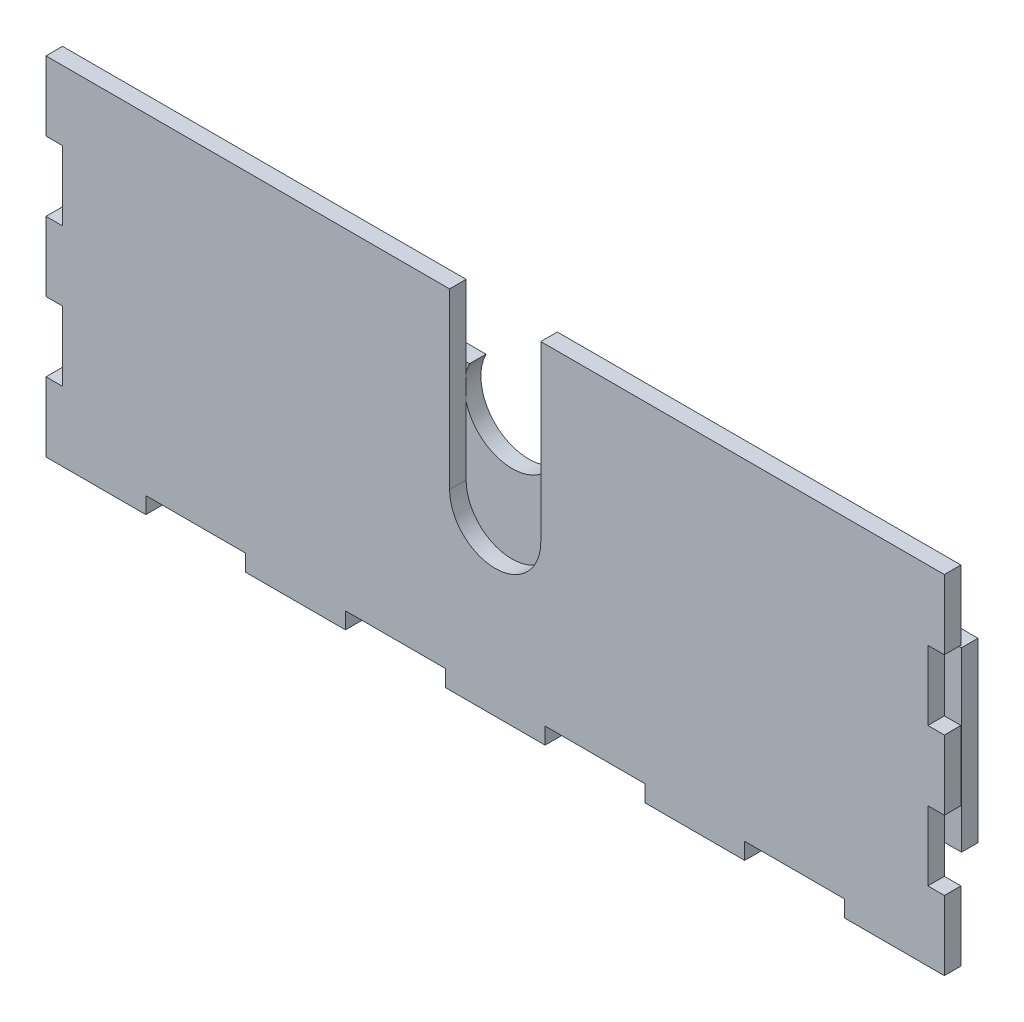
ISO-10303-21;
HEADER;
FILE_DESCRIPTION(('STEP AP214'),'2;1');
FILE_NAME('part.step','',(''),(''),'','','');
FILE_SCHEMA(('AUTOMOTIVE_DESIGN { 1 0 10303 214 1 1 1 1 }'));
ENDSEC;
DATA;
#1=APPLICATION_CONTEXT('core data for automotive mechanical design processes');
#2=APPLICATION_PROTOCOL_DEFINITION('international standard','automotive_design',2000,#1);
#3=PRODUCT_CONTEXT('',#1,'mechanical');
#4=PRODUCT('Part','Part','',(#3));
#5=PRODUCT_RELATED_PRODUCT_CATEGORY('part','',(#4));
#6=PRODUCT_DEFINITION_FORMATION('','',#4);
#7=PRODUCT_DEFINITION_CONTEXT('part definition',#1,'design');
#8=PRODUCT_DEFINITION('design','',#6,#7);
#9=PRODUCT_DEFINITION_SHAPE('','',#8);
#10=(LENGTH_UNIT() NAMED_UNIT(*) SI_UNIT(.MILLI.,.METRE.));
#11=(NAMED_UNIT(*) PLANE_ANGLE_UNIT() SI_UNIT($,.RADIAN.));
#12=(NAMED_UNIT(*) SI_UNIT($,.STERADIAN.) SOLID_ANGLE_UNIT());
#13=UNCERTAINTY_MEASURE_WITH_UNIT(LENGTH_MEASURE(1.E-05),#10,'distance_accuracy_value','');
#14=(GEOMETRIC_REPRESENTATION_CONTEXT(3) GLOBAL_UNCERTAINTY_ASSIGNED_CONTEXT((#13)) GLOBAL_UNIT_ASSIGNED_CONTEXT((#10,
#11,#12)) REPRESENTATION_CONTEXT('',''));
#15=CARTESIAN_POINT('',(0.,0.,0.));
#16=DIRECTION('',(0.,0.,1.));
#17=DIRECTION('',(1.,0.,0.));
#18=AXIS2_PLACEMENT_3D('',#15,#16,#17);
#19=CARTESIAN_POINT('',(185.883,32.8963974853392,15.24));
#20=DIRECTION('',(0.,-1.,0.));
#21=DIRECTION('',(1.,0.,0.));
#22=AXIS2_PLACEMENT_3D('',#19,#20,#21);
#23=PLANE('',#22);
#24=DIRECTION('',(-1.,0.,0.));
#25=VECTOR('',#24,1.);
#26=CARTESIAN_POINT('',(185.883,32.8963974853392,7.62));
#27=LINE('',#26,#25);
#28=CARTESIAN_POINT('',(185.883,32.8963974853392,7.62));
#29=VERTEX_POINT('',#28);
#30=CARTESIAN_POINT('',(0.,32.8963974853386,7.62));
#31=VERTEX_POINT('',#30);
#32=EDGE_CURVE('E336',#29,#31,#27,.T.);
#33=ORIENTED_EDGE('',*,*,#32,.T.);
#34=DIRECTION('',(0.,0.,-1.));
#35=VECTOR('',#34,1.);
#36=CARTESIAN_POINT('',(0.,32.8963974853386,15.24));
#37=LINE('',#36,#35);
#38=CARTESIAN_POINT('',(0.,32.8963974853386,15.24));
#39=VERTEX_POINT('',#38);
#40=EDGE_CURVE('E12',#39,#31,#37,.T.);
#41=ORIENTED_EDGE('',*,*,#40,.F.);
#42=DIRECTION('',(-1.,0.,0.));
#43=VECTOR('',#42,1.);
#44=CARTESIAN_POINT('',(185.883,32.8963974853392,15.24));
#45=LINE('',#44,#43);
#46=CARTESIAN_POINT('',(185.883,32.8963974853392,15.24));
#47=VERTEX_POINT('',#46);
#48=EDGE_CURVE('E414',#47,#39,#45,.T.);
#49=ORIENTED_EDGE('',*,*,#48,.F.);
#50=DIRECTION('',(0.,0.,-1.));
#51=VECTOR('',#50,1.);
#52=CARTESIAN_POINT('',(185.883,32.8963974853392,15.24));
#53=LINE('',#52,#51);
#54=EDGE_CURVE('E332',#47,#29,#53,.T.);
#55=ORIENTED_EDGE('',*,*,#54,.T.);
#56=EDGE_LOOP('',(#33,#41,#49,#55));
#57=FACE_BOUND('',#56,.T.);
#58=ADVANCED_FACE('F48',(#57),#23,.F.);
#59=CARTESIAN_POINT('',(0.,32.8963974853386,15.24));
#60=DIRECTION('',(1.,0.,0.));
#61=DIRECTION('',(0.,1.,0.));
#62=AXIS2_PLACEMENT_3D('',#59,#60,#61);
#63=PLANE('',#62);
#64=DIRECTION('',(0.,-1.,0.));
#65=VECTOR('',#64,1.);
#66=CARTESIAN_POINT('',(0.,32.8963974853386,7.62));
#67=LINE('',#66,#65);
#68=CARTESIAN_POINT('',(0.,0.896397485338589,7.62));
#69=VERTEX_POINT('',#68);
#70=EDGE_CURVE('E339',#31,#69,#67,.T.);
#71=ORIENTED_EDGE('',*,*,#70,.T.);
#72=DIRECTION('',(0.,0.,-1.));
#73=VECTOR('',#72,1.);
#74=CARTESIAN_POINT('',(0.,0.896397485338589,15.24));
#75=LINE('',#74,#73);
#76=CARTESIAN_POINT('',(0.,0.896397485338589,15.24));
#77=VERTEX_POINT('',#76);
#78=EDGE_CURVE('E56',#77,#69,#75,.T.);
#79=ORIENTED_EDGE('',*,*,#78,.F.);
#80=DIRECTION('',(0.,-1.,0.));
#81=VECTOR('',#80,1.);
#82=CARTESIAN_POINT('',(0.,32.8963974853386,15.24));
#83=LINE('',#82,#81);
#84=EDGE_CURVE('E203',#39,#77,#83,.T.);
#85=ORIENTED_EDGE('',*,*,#84,.F.);
#86=ORIENTED_EDGE('',*,*,#40,.T.);
#87=EDGE_LOOP('',(#71,#79,#85,#86));
#88=FACE_BOUND('',#87,.T.);
#89=ADVANCED_FACE('F632',(#88),#63,.F.);
#90=CARTESIAN_POINT('',(0.,0.896397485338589,15.24));
#91=DIRECTION('',(0.,1.,0.));
#92=DIRECTION('',(-1.,0.,0.));
#93=AXIS2_PLACEMENT_3D('',#90,#91,#92);
#94=PLANE('',#93);
#95=DIRECTION('',(1.,0.,0.));
#96=VECTOR('',#95,1.);
#97=CARTESIAN_POINT('',(0.,0.896397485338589,7.62));
#98=LINE('',#97,#96);
#99=CARTESIAN_POINT('',(7.62,0.896397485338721,7.62));
#100=VERTEX_POINT('',#99);
#101=EDGE_CURVE('E341',#69,#100,#98,.T.);
#102=ORIENTED_EDGE('',*,*,#101,.T.);
#103=DIRECTION('',(0.,0.,-1.));
#104=VECTOR('',#103,1.);
#105=CARTESIAN_POINT('',(7.62,0.896397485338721,15.24));
#106=LINE('',#105,#104);
#107=CARTESIAN_POINT('',(7.62,0.896397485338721,15.24));
#108=VERTEX_POINT('',#107);
#109=EDGE_CURVE('E517',#108,#100,#106,.T.);
#110=ORIENTED_EDGE('',*,*,#109,.F.);
#111=DIRECTION('',(1.,0.,0.));
#112=VECTOR('',#111,1.);
#113=CARTESIAN_POINT('',(0.,0.896397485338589,15.24));
#114=LINE('',#113,#112);
#115=EDGE_CURVE('E525',#77,#108,#114,.T.);
#116=ORIENTED_EDGE('',*,*,#115,.F.);
#117=ORIENTED_EDGE('',*,*,#78,.T.);
#118=EDGE_LOOP('',(#102,#110,#116,#117));
#119=FACE_BOUND('',#118,.T.);
#120=ADVANCED_FACE('F523',(#119),#94,.F.);
#121=CARTESIAN_POINT('',(7.62,0.896397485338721,15.24));
#122=DIRECTION('',(1.,0.,0.));
#123=DIRECTION('',(0.,1.,0.));
#124=AXIS2_PLACEMENT_3D('',#121,#122,#123);
#125=PLANE('',#124);
#126=DIRECTION('',(0.,-1.,0.));
#127=VECTOR('',#126,1.);
#128=CARTESIAN_POINT('',(7.62,0.896397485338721,7.62));
#129=LINE('',#128,#127);
#130=CARTESIAN_POINT('',(7.62000000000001,-31.1036025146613,7.62));
#131=VERTEX_POINT('',#130);
#132=EDGE_CURVE('E343',#100,#131,#129,.T.);
#133=ORIENTED_EDGE('',*,*,#132,.T.);
#134=DIRECTION('',(0.,0.,-1.));
#135=VECTOR('',#134,1.);
#136=CARTESIAN_POINT('',(7.62000000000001,-31.1036025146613,15.24));
#137=LINE('',#136,#135);
#138=CARTESIAN_POINT('',(7.62000000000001,-31.1036025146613,15.24));
#139=VERTEX_POINT('',#138);
#140=EDGE_CURVE('E514',#139,#131,#137,.T.);
#141=ORIENTED_EDGE('',*,*,#140,.F.);
#142=DIRECTION('',(0.,-1.,0.));
#143=VECTOR('',#142,1.);
#144=CARTESIAN_POINT('',(7.62,0.896397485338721,15.24));
#145=LINE('',#144,#143);
#146=EDGE_CURVE('E543',#108,#139,#145,.T.);
#147=ORIENTED_EDGE('',*,*,#146,.F.);
#148=ORIENTED_EDGE('',*,*,#109,.T.);
#149=EDGE_LOOP('',(#133,#141,#147,#148));
#150=FACE_BOUND('',#149,.T.);
#151=ADVANCED_FACE('F534',(#150),#125,.F.);
#152=CARTESIAN_POINT('',(7.62000000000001,-31.1036025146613,15.24));
#153=DIRECTION('',(0.,-1.,0.));
#154=DIRECTION('',(1.,0.,0.));
#155=AXIS2_PLACEMENT_3D('',#152,#153,#154);
#156=PLANE('',#155);
#157=DIRECTION('',(-1.,0.,0.));
#158=VECTOR('',#157,1.);
#159=CARTESIAN_POINT('',(7.62000000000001,-31.1036025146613,7.62));
#160=LINE('',#159,#158);
#161=CARTESIAN_POINT('',(0.,-31.1036025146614,7.62));
#162=VERTEX_POINT('',#161);
#163=EDGE_CURVE('E345',#131,#162,#160,.T.);
#164=ORIENTED_EDGE('',*,*,#163,.T.);
#165=DIRECTION('',(0.,0.,-1.));
#166=VECTOR('',#165,1.);
#167=CARTESIAN_POINT('',(0.,-31.1036025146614,15.24));
#168=LINE('',#167,#166);
#169=CARTESIAN_POINT('',(0.,-31.1036025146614,15.24));
#170=VERTEX_POINT('',#169);
#171=EDGE_CURVE('E511',#170,#162,#168,.T.);
#172=ORIENTED_EDGE('',*,*,#171,.F.);
#173=DIRECTION('',(-1.,0.,0.));
#174=VECTOR('',#173,1.);
#175=CARTESIAN_POINT('',(7.62000000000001,-31.1036025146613,15.24));
#176=LINE('',#175,#174);
#177=EDGE_CURVE('E540',#139,#170,#176,.T.);
#178=ORIENTED_EDGE('',*,*,#177,.F.);
#179=ORIENTED_EDGE('',*,*,#140,.T.);
#180=EDGE_LOOP('',(#164,#172,#178,#179));
#181=FACE_BOUND('',#180,.T.);
#182=ADVANCED_FACE('F538',(#181),#156,.F.);
#183=CARTESIAN_POINT('',(0.,-31.1036025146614,15.24));
#184=DIRECTION('',(1.,0.,0.));
#185=DIRECTION('',(0.,1.,0.));
#186=AXIS2_PLACEMENT_3D('',#183,#184,#185);
#187=PLANE('',#186);
#188=DIRECTION('',(0.,-1.,0.));
#189=VECTOR('',#188,1.);
#190=CARTESIAN_POINT('',(0.,-31.1036025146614,7.62));
#191=LINE('',#190,#189);
#192=CARTESIAN_POINT('',(0.,-63.1036025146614,7.62));
#193=VERTEX_POINT('',#192);
#194=EDGE_CURVE('E347',#162,#193,#191,.T.);
#195=ORIENTED_EDGE('',*,*,#194,.T.);
#196=DIRECTION('',(0.,0.,-1.));
#197=VECTOR('',#196,1.);
#198=CARTESIAN_POINT('',(0.,-63.1036025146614,15.24));
#199=LINE('',#198,#197);
#200=CARTESIAN_POINT('',(0.,-63.1036025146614,15.24));
#201=VERTEX_POINT('',#200);
#202=EDGE_CURVE('E508',#201,#193,#199,.T.);
#203=ORIENTED_EDGE('',*,*,#202,.F.);
#204=DIRECTION('',(0.,-1.,0.));
#205=VECTOR('',#204,1.);
#206=CARTESIAN_POINT('',(0.,-31.1036025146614,15.24));
#207=LINE('',#206,#205);
#208=EDGE_CURVE('E542',#170,#201,#207,.T.);
#209=ORIENTED_EDGE('',*,*,#208,.F.);
#210=ORIENTED_EDGE('',*,*,#171,.T.);
#211=EDGE_LOOP('',(#195,#203,#209,#210));
#212=FACE_BOUND('',#211,.T.);
#213=ADVANCED_FACE('F645',(#212),#187,.F.);
#214=CARTESIAN_POINT('',(0.,-63.1036025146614,15.24));
#215=DIRECTION('',(0.,1.,0.));
#216=DIRECTION('',(-1.,0.,0.));
#217=AXIS2_PLACEMENT_3D('',#214,#215,#216);
#218=PLANE('',#217);
#219=DIRECTION('',(1.,0.,0.));
#220=VECTOR('',#219,1.);
#221=CARTESIAN_POINT('',(0.,-63.1036025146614,7.62));
#222=LINE('',#221,#220);
#223=CARTESIAN_POINT('',(7.62,-63.1036025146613,7.62));
#224=VERTEX_POINT('',#223);
#225=EDGE_CURVE('E349',#193,#224,#222,.T.);
#226=ORIENTED_EDGE('',*,*,#225,.T.);
#227=DIRECTION('',(0.,0.,-1.));
#228=VECTOR('',#227,1.);
#229=CARTESIAN_POINT('',(7.62,-63.1036025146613,15.24));
#230=LINE('',#229,#228);
#231=CARTESIAN_POINT('',(7.62,-63.1036025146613,15.24));
#232=VERTEX_POINT('',#231);
#233=EDGE_CURVE('E505',#232,#224,#230,.T.);
#234=ORIENTED_EDGE('',*,*,#233,.F.);
#235=DIRECTION('',(1.,0.,0.));
#236=VECTOR('',#235,1.);
#237=CARTESIAN_POINT('',(0.,-63.1036025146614,15.24));
#238=LINE('',#237,#236);
#239=EDGE_CURVE('E545',#201,#232,#238,.T.);
#240=ORIENTED_EDGE('',*,*,#239,.F.);
#241=ORIENTED_EDGE('',*,*,#202,.T.);
#242=EDGE_LOOP('',(#226,#234,#240,#241));
#243=FACE_BOUND('',#242,.T.);
#244=ADVANCED_FACE('F648',(#243),#218,.F.);
#245=CARTESIAN_POINT('',(7.62,-63.1036025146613,15.24));
#246=DIRECTION('',(1.,0.,0.));
#247=DIRECTION('',(0.,1.,0.));
#248=AXIS2_PLACEMENT_3D('',#245,#246,#247);
#249=PLANE('',#248);
#250=DIRECTION('',(0.,-1.,0.));
#251=VECTOR('',#250,1.);
#252=CARTESIAN_POINT('',(7.62,-63.1036025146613,7.62));
#253=LINE('',#252,#251);
#254=CARTESIAN_POINT('',(7.62000000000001,-95.1036025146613,7.62));
#255=VERTEX_POINT('',#254);
#256=EDGE_CURVE('E351',#224,#255,#253,.T.);
#257=ORIENTED_EDGE('',*,*,#256,.T.);
#258=DIRECTION('',(0.,0.,-1.));
#259=VECTOR('',#258,1.);
#260=CARTESIAN_POINT('',(7.62000000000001,-95.1036025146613,15.24));
#261=LINE('',#260,#259);
#262=CARTESIAN_POINT('',(7.62000000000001,-95.1036025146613,15.24));
#263=VERTEX_POINT('',#262);
#264=EDGE_CURVE('E502',#263,#255,#261,.T.);
#265=ORIENTED_EDGE('',*,*,#264,.F.);
#266=DIRECTION('',(0.,-1.,0.));
#267=VECTOR('',#266,1.);
#268=CARTESIAN_POINT('',(7.62,-63.1036025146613,15.24));
#269=LINE('',#268,#267);
#270=EDGE_CURVE('E551',#232,#263,#269,.T.);
#271=ORIENTED_EDGE('',*,*,#270,.F.);
#272=ORIENTED_EDGE('',*,*,#233,.T.);
#273=EDGE_LOOP('',(#257,#265,#271,#272));
#274=FACE_BOUND('',#273,.T.);
#275=ADVANCED_FACE('F652',(#274),#249,.F.);
#276=CARTESIAN_POINT('',(7.62000000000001,-95.1036025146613,15.24));
#277=DIRECTION('',(0.,-1.,0.));
#278=DIRECTION('',(0.,0.,-1.));
#279=AXIS2_PLACEMENT_3D('',#276,#277,#278);
#280=PLANE('',#279);
#281=DIRECTION('',(-1.,0.,0.));
#282=VECTOR('',#281,1.);
#283=CARTESIAN_POINT('',(7.62000000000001,-95.1036025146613,7.62));
#284=LINE('',#283,#282);
#285=CARTESIAN_POINT('',(0.,-95.1036025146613,7.62));
#286=VERTEX_POINT('',#285);
#287=EDGE_CURVE('E353',#255,#286,#284,.T.);
#288=ORIENTED_EDGE('',*,*,#287,.T.);
#289=DIRECTION('',(0.,0.,-1.));
#290=VECTOR('',#289,1.);
#291=CARTESIAN_POINT('',(0.,-95.1036025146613,15.24));
#292=LINE('',#291,#290);
#293=CARTESIAN_POINT('',(0.,-95.1036025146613,15.24));
#294=VERTEX_POINT('',#293);
#295=EDGE_CURVE('E499',#294,#286,#292,.T.);
#296=ORIENTED_EDGE('',*,*,#295,.F.);
#297=DIRECTION('',(-1.,0.,0.));
#298=VECTOR('',#297,1.);
#299=CARTESIAN_POINT('',(7.62000000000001,-95.1036025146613,15.24));
#300=LINE('',#299,#298);
#301=EDGE_CURVE('E553',#263,#294,#300,.T.);
#302=ORIENTED_EDGE('',*,*,#301,.F.);
#303=ORIENTED_EDGE('',*,*,#264,.T.);
#304=EDGE_LOOP('',(#288,#296,#302,#303));
#305=FACE_BOUND('',#304,.T.);
#306=ADVANCED_FACE('F656',(#305),#280,.F.);
#307=CARTESIAN_POINT('',(0.,-95.1036025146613,15.24));
#308=DIRECTION('',(1.,0.,0.));
#309=DIRECTION('',(0.,1.,0.));
#310=AXIS2_PLACEMENT_3D('',#307,#308,#309);
#311=PLANE('',#310);
#312=DIRECTION('',(0.,-1.,0.));
#313=VECTOR('',#312,1.);
#314=CARTESIAN_POINT('',(0.,-95.1036025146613,7.62));
#315=LINE('',#314,#313);
#316=CARTESIAN_POINT('',(0.,-127.103602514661,7.62));
#317=VERTEX_POINT('',#316);
#318=EDGE_CURVE('E355',#286,#317,#315,.T.);
#319=ORIENTED_EDGE('',*,*,#318,.T.);
#320=DIRECTION('',(0.,0.,-1.));
#321=VECTOR('',#320,1.);
#322=CARTESIAN_POINT('',(0.,-127.103602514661,15.24));
#323=LINE('',#322,#321);
#324=CARTESIAN_POINT('',(0.,-127.103602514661,15.24));
#325=VERTEX_POINT('',#324);
#326=EDGE_CURVE('E496',#325,#317,#323,.T.);
#327=ORIENTED_EDGE('',*,*,#326,.F.);
#328=DIRECTION('',(0.,-1.,0.));
#329=VECTOR('',#328,1.);
#330=CARTESIAN_POINT('',(0.,-95.1036025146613,15.24));
#331=LINE('',#330,#329);
#332=EDGE_CURVE('E555',#294,#325,#331,.T.);
#333=ORIENTED_EDGE('',*,*,#332,.F.);
#334=ORIENTED_EDGE('',*,*,#295,.T.);
#335=EDGE_LOOP('',(#319,#327,#333,#334));
#336=FACE_BOUND('',#335,.T.);
#337=ADVANCED_FACE('F660',(#336),#311,.F.);
#338=CARTESIAN_POINT('',(45.974,-127.103602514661,15.24));
#339=DIRECTION('',(0.,1.,0.));
#340=DIRECTION('',(0.,0.,1.));
#341=AXIS2_PLACEMENT_3D('',#338,#339,#340);
#342=PLANE('',#341);
#343=DIRECTION('',(1.,0.,0.));
#344=VECTOR('',#343,1.);
#345=CARTESIAN_POINT('',(45.974,-127.103602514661,7.62));
#346=LINE('',#345,#344);
#347=CARTESIAN_POINT('',(45.974,-127.103602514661,7.62));
#348=VERTEX_POINT('',#347);
#349=EDGE_CURVE('E357',#317,#348,#346,.T.);
#350=ORIENTED_EDGE('',*,*,#349,.T.);
#351=DIRECTION('',(0.,0.,-1.));
#352=VECTOR('',#351,1.);
#353=CARTESIAN_POINT('',(45.974,-127.103602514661,15.24));
#354=LINE('',#353,#352);
#355=CARTESIAN_POINT('',(45.974,-127.103602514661,15.24));
#356=VERTEX_POINT('',#355);
#357=EDGE_CURVE('E493',#356,#348,#354,.T.);
#358=ORIENTED_EDGE('',*,*,#357,.F.);
#359=DIRECTION('',(1.,0.,0.));
#360=VECTOR('',#359,1.);
#361=CARTESIAN_POINT('',(45.974,-127.103602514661,15.24));
#362=LINE('',#361,#360);
#363=EDGE_CURVE('E557',#325,#356,#362,.T.);
#364=ORIENTED_EDGE('',*,*,#363,.F.);
#365=ORIENTED_EDGE('',*,*,#326,.T.);
#366=EDGE_LOOP('',(#350,#358,#364,#365));
#367=FACE_BOUND('',#366,.T.);
#368=ADVANCED_FACE('F664',(#367),#342,.F.);
#369=CARTESIAN_POINT('',(45.974,-119.483602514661,15.24));
#370=DIRECTION('',(-1.,0.,0.));
#371=DIRECTION('',(0.,0.,1.));
#372=AXIS2_PLACEMENT_3D('',#369,#370,#371);
#373=PLANE('',#372);
#374=DIRECTION('',(0.,1.,0.));
#375=VECTOR('',#374,1.);
#376=CARTESIAN_POINT('',(45.974,-119.483602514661,7.62));
#377=LINE('',#376,#375);
#378=CARTESIAN_POINT('',(45.974,-119.483602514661,7.62));
#379=VERTEX_POINT('',#378);
#380=EDGE_CURVE('E359',#348,#379,#377,.T.);
#381=ORIENTED_EDGE('',*,*,#380,.T.);
#382=DIRECTION('',(0.,0.,-1.));
#383=VECTOR('',#382,1.);
#384=CARTESIAN_POINT('',(45.974,-119.483602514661,15.24));
#385=LINE('',#384,#383);
#386=CARTESIAN_POINT('',(45.974,-119.483602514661,15.24));
#387=VERTEX_POINT('',#386);
#388=EDGE_CURVE('E490',#387,#379,#385,.T.);
#389=ORIENTED_EDGE('',*,*,#388,.F.);
#390=DIRECTION('',(0.,1.,0.));
#391=VECTOR('',#390,1.);
#392=CARTESIAN_POINT('',(45.974,-119.483602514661,15.24));
#393=LINE('',#392,#391);
#394=EDGE_CURVE('E559',#356,#387,#393,.T.);
#395=ORIENTED_EDGE('',*,*,#394,.F.);
#396=ORIENTED_EDGE('',*,*,#357,.T.);
#397=EDGE_LOOP('',(#381,#389,#395,#396));
#398=FACE_BOUND('',#397,.T.);
#399=ADVANCED_FACE('F668',(#398),#373,.F.);
#400=CARTESIAN_POINT('',(91.948,-119.483602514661,15.24));
#401=DIRECTION('',(0.,1.,0.));
#402=DIRECTION('',(-1.,0.,0.));
#403=AXIS2_PLACEMENT_3D('',#400,#401,#402);
#404=PLANE('',#403);
#405=DIRECTION('',(1.,0.,0.));
#406=VECTOR('',#405,1.);
#407=CARTESIAN_POINT('',(91.948,-119.483602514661,7.62));
#408=LINE('',#407,#406);
#409=CARTESIAN_POINT('',(91.948,-119.483602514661,7.62));
#410=VERTEX_POINT('',#409);
#411=EDGE_CURVE('E361',#379,#410,#408,.T.);
#412=ORIENTED_EDGE('',*,*,#411,.T.);
#413=DIRECTION('',(0.,0.,-1.));
#414=VECTOR('',#413,1.);
#415=CARTESIAN_POINT('',(91.948,-119.483602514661,15.24));
#416=LINE('',#415,#414);
#417=CARTESIAN_POINT('',(91.948,-119.483602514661,15.24));
#418=VERTEX_POINT('',#417);
#419=EDGE_CURVE('E487',#418,#410,#416,.T.);
#420=ORIENTED_EDGE('',*,*,#419,.F.);
#421=DIRECTION('',(1.,0.,0.));
#422=VECTOR('',#421,1.);
#423=CARTESIAN_POINT('',(91.948,-119.483602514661,15.24));
#424=LINE('',#423,#422);
#425=EDGE_CURVE('E561',#387,#418,#424,.T.);
#426=ORIENTED_EDGE('',*,*,#425,.F.);
#427=ORIENTED_EDGE('',*,*,#388,.T.);
#428=EDGE_LOOP('',(#412,#420,#426,#427));
#429=FACE_BOUND('',#428,.T.);
#430=ADVANCED_FACE('F672',(#429),#404,.F.);
#431=CARTESIAN_POINT('',(91.948,-127.103602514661,15.24));
#432=DIRECTION('',(1.,0.,0.));
#433=DIRECTION('',(0.,0.,-1.));
#434=AXIS2_PLACEMENT_3D('',#431,#432,#433);
#435=PLANE('',#434);
#436=DIRECTION('',(0.,-1.,0.));
#437=VECTOR('',#436,1.);
#438=CARTESIAN_POINT('',(91.948,-127.103602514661,7.62));
#439=LINE('',#438,#437);
#440=CARTESIAN_POINT('',(91.948,-127.103602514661,7.62));
#441=VERTEX_POINT('',#440);
#442=EDGE_CURVE('E363',#410,#441,#439,.T.);
#443=ORIENTED_EDGE('',*,*,#442,.T.);
#444=DIRECTION('',(0.,0.,-1.));
#445=VECTOR('',#444,1.);
#446=CARTESIAN_POINT('',(91.948,-127.103602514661,15.24));
#447=LINE('',#446,#445);
#448=CARTESIAN_POINT('',(91.948,-127.103602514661,15.24));
#449=VERTEX_POINT('',#448);
#450=EDGE_CURVE('E484',#449,#441,#447,.T.);
#451=ORIENTED_EDGE('',*,*,#450,.F.);
#452=DIRECTION('',(0.,-1.,0.));
#453=VECTOR('',#452,1.);
#454=CARTESIAN_POINT('',(91.948,-127.103602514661,15.24));
#455=LINE('',#454,#453);
#456=EDGE_CURVE('E563',#418,#449,#455,.T.);
#457=ORIENTED_EDGE('',*,*,#456,.F.);
#458=ORIENTED_EDGE('',*,*,#419,.T.);
#459=EDGE_LOOP('',(#443,#451,#457,#458));
#460=FACE_BOUND('',#459,.T.);
#461=ADVANCED_FACE('F676',(#460),#435,.F.);
#462=CARTESIAN_POINT('',(137.922,-127.103602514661,15.24));
#463=DIRECTION('',(0.,1.,0.));
#464=DIRECTION('',(-1.,0.,0.));
#465=AXIS2_PLACEMENT_3D('',#462,#463,#464);
#466=PLANE('',#465);
#467=DIRECTION('',(1.,0.,0.));
#468=VECTOR('',#467,1.);
#469=CARTESIAN_POINT('',(137.922,-127.103602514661,7.62));
#470=LINE('',#469,#468);
#471=CARTESIAN_POINT('',(137.922,-127.103602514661,7.62));
#472=VERTEX_POINT('',#471);
#473=EDGE_CURVE('E365',#441,#472,#470,.T.);
#474=ORIENTED_EDGE('',*,*,#473,.T.);
#475=DIRECTION('',(0.,0.,-1.));
#476=VECTOR('',#475,1.);
#477=CARTESIAN_POINT('',(137.922,-127.103602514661,15.24));
#478=LINE('',#477,#476);
#479=CARTESIAN_POINT('',(137.922,-127.103602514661,15.24));
#480=VERTEX_POINT('',#479);
#481=EDGE_CURVE('E481',#480,#472,#478,.T.);
#482=ORIENTED_EDGE('',*,*,#481,.F.);
#483=DIRECTION('',(1.,0.,0.));
#484=VECTOR('',#483,1.);
#485=CARTESIAN_POINT('',(137.922,-127.103602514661,15.24));
#486=LINE('',#485,#484);
#487=EDGE_CURVE('E565',#449,#480,#486,.T.);
#488=ORIENTED_EDGE('',*,*,#487,.F.);
#489=ORIENTED_EDGE('',*,*,#450,.T.);
#490=EDGE_LOOP('',(#474,#482,#488,#489));
#491=FACE_BOUND('',#490,.T.);
#492=ADVANCED_FACE('F680',(#491),#466,.F.);
#493=CARTESIAN_POINT('',(137.922,-119.483602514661,15.24));
#494=DIRECTION('',(-1.,0.,0.));
#495=DIRECTION('',(0.,-1.,0.));
#496=AXIS2_PLACEMENT_3D('',#493,#494,#495);
#497=PLANE('',#496);
#498=DIRECTION('',(0.,1.,0.));
#499=VECTOR('',#498,1.);
#500=CARTESIAN_POINT('',(137.922,-119.483602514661,7.62));
#501=LINE('',#500,#499);
#502=CARTESIAN_POINT('',(137.922,-119.483602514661,7.62));
#503=VERTEX_POINT('',#502);
#504=EDGE_CURVE('E367',#472,#503,#501,.T.);
#505=ORIENTED_EDGE('',*,*,#504,.T.);
#506=DIRECTION('',(0.,0.,-1.));
#507=VECTOR('',#506,1.);
#508=CARTESIAN_POINT('',(137.922,-119.483602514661,15.24));
#509=LINE('',#508,#507);
#510=CARTESIAN_POINT('',(137.922,-119.483602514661,15.24));
#511=VERTEX_POINT('',#510);
#512=EDGE_CURVE('E478',#511,#503,#509,.T.);
#513=ORIENTED_EDGE('',*,*,#512,.F.);
#514=DIRECTION('',(0.,1.,0.));
#515=VECTOR('',#514,1.);
#516=CARTESIAN_POINT('',(137.922,-119.483602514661,15.24));
#517=LINE('',#516,#515);
#518=EDGE_CURVE('E567',#480,#511,#517,.T.);
#519=ORIENTED_EDGE('',*,*,#518,.F.);
#520=ORIENTED_EDGE('',*,*,#481,.T.);
#521=EDGE_LOOP('',(#505,#513,#519,#520));
#522=FACE_BOUND('',#521,.T.);
#523=ADVANCED_FACE('F684',(#522),#497,.F.);
#524=CARTESIAN_POINT('',(183.896,-119.483602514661,15.24));
#525=DIRECTION('',(0.,1.,0.));
#526=DIRECTION('',(-1.,0.,0.));
#527=AXIS2_PLACEMENT_3D('',#524,#525,#526);
#528=PLANE('',#527);
#529=DIRECTION('',(1.,0.,0.));
#530=VECTOR('',#529,1.);
#531=CARTESIAN_POINT('',(183.896,-119.483602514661,7.62));
#532=LINE('',#531,#530);
#533=CARTESIAN_POINT('',(183.896,-119.483602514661,7.62));
#534=VERTEX_POINT('',#533);
#535=EDGE_CURVE('E369',#503,#534,#532,.T.);
#536=ORIENTED_EDGE('',*,*,#535,.T.);
#537=DIRECTION('',(0.,0.,-1.));
#538=VECTOR('',#537,1.);
#539=CARTESIAN_POINT('',(183.896,-119.483602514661,15.24));
#540=LINE('',#539,#538);
#541=CARTESIAN_POINT('',(183.896,-119.483602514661,15.24));
#542=VERTEX_POINT('',#541);
#543=EDGE_CURVE('E475',#542,#534,#540,.T.);
#544=ORIENTED_EDGE('',*,*,#543,.F.);
#545=DIRECTION('',(1.,0.,0.));
#546=VECTOR('',#545,1.);
#547=CARTESIAN_POINT('',(183.896,-119.483602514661,15.24));
#548=LINE('',#547,#546);
#549=EDGE_CURVE('E569',#511,#542,#548,.T.);
#550=ORIENTED_EDGE('',*,*,#549,.F.);
#551=ORIENTED_EDGE('',*,*,#512,.T.);
#552=EDGE_LOOP('',(#536,#544,#550,#551));
#553=FACE_BOUND('',#552,.T.);
#554=ADVANCED_FACE('F688',(#553),#528,.F.);
#555=CARTESIAN_POINT('',(183.896,-127.103602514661,15.24));
#556=DIRECTION('',(1.,0.,0.));
#557=DIRECTION('',(0.,0.,-1.));
#558=AXIS2_PLACEMENT_3D('',#555,#556,#557);
#559=PLANE('',#558);
#560=DIRECTION('',(0.,-1.,0.));
#561=VECTOR('',#560,1.);
#562=CARTESIAN_POINT('',(183.896,-127.103602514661,7.62));
#563=LINE('',#562,#561);
#564=CARTESIAN_POINT('',(183.896,-127.103602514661,7.62));
#565=VERTEX_POINT('',#564);
#566=EDGE_CURVE('E371',#534,#565,#563,.T.);
#567=ORIENTED_EDGE('',*,*,#566,.T.);
#568=DIRECTION('',(0.,0.,-1.));
#569=VECTOR('',#568,1.);
#570=CARTESIAN_POINT('',(183.896,-127.103602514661,15.24));
#571=LINE('',#570,#569);
#572=CARTESIAN_POINT('',(183.896,-127.103602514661,15.24));
#573=VERTEX_POINT('',#572);
#574=EDGE_CURVE('E472',#573,#565,#571,.T.);
#575=ORIENTED_EDGE('',*,*,#574,.F.);
#576=DIRECTION('',(0.,-1.,0.));
#577=VECTOR('',#576,1.);
#578=CARTESIAN_POINT('',(183.896,-127.103602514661,15.24));
#579=LINE('',#578,#577);
#580=EDGE_CURVE('E571',#542,#573,#579,.T.);
#581=ORIENTED_EDGE('',*,*,#580,.F.);
#582=ORIENTED_EDGE('',*,*,#543,.T.);
#583=EDGE_LOOP('',(#567,#575,#581,#582));
#584=FACE_BOUND('',#583,.T.);
#585=ADVANCED_FACE('F692',(#584),#559,.F.);
#586=CARTESIAN_POINT('',(229.87,-127.103602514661,15.24));
#587=DIRECTION('',(0.,1.,0.));
#588=DIRECTION('',(-1.,0.,0.));
#589=AXIS2_PLACEMENT_3D('',#586,#587,#588);
#590=PLANE('',#589);
#591=DIRECTION('',(1.,0.,0.));
#592=VECTOR('',#591,1.);
#593=CARTESIAN_POINT('',(229.87,-127.103602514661,7.62));
#594=LINE('',#593,#592);
#595=CARTESIAN_POINT('',(229.87,-127.103602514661,7.62));
#596=VERTEX_POINT('',#595);
#597=EDGE_CURVE('E373',#565,#596,#594,.T.);
#598=ORIENTED_EDGE('',*,*,#597,.T.);
#599=DIRECTION('',(0.,0.,-1.));
#600=VECTOR('',#599,1.);
#601=CARTESIAN_POINT('',(229.87,-127.103602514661,15.24));
#602=LINE('',#601,#600);
#603=CARTESIAN_POINT('',(229.87,-127.103602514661,15.24));
#604=VERTEX_POINT('',#603);
#605=EDGE_CURVE('E469',#604,#596,#602,.T.);
#606=ORIENTED_EDGE('',*,*,#605,.F.);
#607=DIRECTION('',(1.,0.,0.));
#608=VECTOR('',#607,1.);
#609=CARTESIAN_POINT('',(229.87,-127.103602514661,15.24));
#610=LINE('',#609,#608);
#611=EDGE_CURVE('E573',#573,#604,#610,.T.);
#612=ORIENTED_EDGE('',*,*,#611,.F.);
#613=ORIENTED_EDGE('',*,*,#574,.T.);
#614=EDGE_LOOP('',(#598,#606,#612,#613));
#615=FACE_BOUND('',#614,.T.);
#616=ADVANCED_FACE('F696',(#615),#590,.F.);
#617=CARTESIAN_POINT('',(229.87,-119.483602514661,15.24));
#618=DIRECTION('',(-1.,0.,0.));
#619=DIRECTION('',(0.,-1.,0.));
#620=AXIS2_PLACEMENT_3D('',#617,#618,#619);
#621=PLANE('',#620);
#622=DIRECTION('',(0.,1.,0.));
#623=VECTOR('',#622,1.);
#624=CARTESIAN_POINT('',(229.87,-119.483602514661,7.62));
#625=LINE('',#624,#623);
#626=CARTESIAN_POINT('',(229.87,-119.483602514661,7.62));
#627=VERTEX_POINT('',#626);
#628=EDGE_CURVE('E375',#596,#627,#625,.T.);
#629=ORIENTED_EDGE('',*,*,#628,.T.);
#630=DIRECTION('',(0.,0.,-1.));
#631=VECTOR('',#630,1.);
#632=CARTESIAN_POINT('',(229.87,-119.483602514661,15.24));
#633=LINE('',#632,#631);
#634=CARTESIAN_POINT('',(229.87,-119.483602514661,15.24));
#635=VERTEX_POINT('',#634);
#636=EDGE_CURVE('E466',#635,#627,#633,.T.);
#637=ORIENTED_EDGE('',*,*,#636,.F.);
#638=DIRECTION('',(0.,1.,0.));
#639=VECTOR('',#638,1.);
#640=CARTESIAN_POINT('',(229.87,-119.483602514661,15.24));
#641=LINE('',#640,#639);
#642=EDGE_CURVE('E575',#604,#635,#641,.T.);
#643=ORIENTED_EDGE('',*,*,#642,.F.);
#644=ORIENTED_EDGE('',*,*,#605,.T.);
#645=EDGE_LOOP('',(#629,#637,#643,#644));
#646=FACE_BOUND('',#645,.T.);
#647=ADVANCED_FACE('F700',(#646),#621,.F.);
#648=CARTESIAN_POINT('',(275.844,-119.483602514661,15.24));
#649=DIRECTION('',(0.,1.,0.));
#650=DIRECTION('',(-1.,0.,0.));
#651=AXIS2_PLACEMENT_3D('',#648,#649,#650);
#652=PLANE('',#651);
#653=DIRECTION('',(1.,0.,0.));
#654=VECTOR('',#653,1.);
#655=CARTESIAN_POINT('',(275.844,-119.483602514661,7.62));
#656=LINE('',#655,#654);
#657=CARTESIAN_POINT('',(275.844,-119.483602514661,7.62));
#658=VERTEX_POINT('',#657);
#659=EDGE_CURVE('E377',#627,#658,#656,.T.);
#660=ORIENTED_EDGE('',*,*,#659,.T.);
#661=DIRECTION('',(0.,0.,-1.));
#662=VECTOR('',#661,1.);
#663=CARTESIAN_POINT('',(275.844,-119.483602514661,15.24));
#664=LINE('',#663,#662);
#665=CARTESIAN_POINT('',(275.844,-119.483602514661,15.24));
#666=VERTEX_POINT('',#665);
#667=EDGE_CURVE('E463',#666,#658,#664,.T.);
#668=ORIENTED_EDGE('',*,*,#667,.F.);
#669=DIRECTION('',(1.,0.,0.));
#670=VECTOR('',#669,1.);
#671=CARTESIAN_POINT('',(275.844,-119.483602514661,15.24));
#672=LINE('',#671,#670);
#673=EDGE_CURVE('E577',#635,#666,#672,.T.);
#674=ORIENTED_EDGE('',*,*,#673,.F.);
#675=ORIENTED_EDGE('',*,*,#636,.T.);
#676=EDGE_LOOP('',(#660,#668,#674,#675));
#677=FACE_BOUND('',#676,.T.);
#678=ADVANCED_FACE('F704',(#677),#652,.F.);
#679=CARTESIAN_POINT('',(275.844,-127.103602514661,15.24));
#680=DIRECTION('',(1.,0.,0.));
#681=DIRECTION('',(0.,0.,-1.));
#682=AXIS2_PLACEMENT_3D('',#679,#680,#681);
#683=PLANE('',#682);
#684=DIRECTION('',(0.,-1.,0.));
#685=VECTOR('',#684,1.);
#686=CARTESIAN_POINT('',(275.844,-127.103602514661,7.62));
#687=LINE('',#686,#685);
#688=CARTESIAN_POINT('',(275.844,-127.103602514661,7.62));
#689=VERTEX_POINT('',#688);
#690=EDGE_CURVE('E379',#658,#689,#687,.T.);
#691=ORIENTED_EDGE('',*,*,#690,.T.);
#692=DIRECTION('',(0.,0.,-1.));
#693=VECTOR('',#692,1.);
#694=CARTESIAN_POINT('',(275.844,-127.103602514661,15.24));
#695=LINE('',#694,#693);
#696=CARTESIAN_POINT('',(275.844,-127.103602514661,15.24));
#697=VERTEX_POINT('',#696);
#698=EDGE_CURVE('E460',#697,#689,#695,.T.);
#699=ORIENTED_EDGE('',*,*,#698,.F.);
#700=DIRECTION('',(0.,-1.,0.));
#701=VECTOR('',#700,1.);
#702=CARTESIAN_POINT('',(275.844,-127.103602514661,15.24));
#703=LINE('',#702,#701);
#704=EDGE_CURVE('E579',#666,#697,#703,.T.);
#705=ORIENTED_EDGE('',*,*,#704,.F.);
#706=ORIENTED_EDGE('',*,*,#667,.T.);
#707=EDGE_LOOP('',(#691,#699,#705,#706));
#708=FACE_BOUND('',#707,.T.);
#709=ADVANCED_FACE('F708',(#708),#683,.F.);
#710=CARTESIAN_POINT('',(321.818,-127.103602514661,15.24));
#711=DIRECTION('',(0.,1.,0.));
#712=DIRECTION('',(-1.,0.,0.));
#713=AXIS2_PLACEMENT_3D('',#710,#711,#712);
#714=PLANE('',#713);
#715=DIRECTION('',(1.,0.,0.));
#716=VECTOR('',#715,1.);
#717=CARTESIAN_POINT('',(321.818,-127.103602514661,7.62));
#718=LINE('',#717,#716);
#719=CARTESIAN_POINT('',(321.818,-127.103602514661,7.62));
#720=VERTEX_POINT('',#719);
#721=EDGE_CURVE('E381',#689,#720,#718,.T.);
#722=ORIENTED_EDGE('',*,*,#721,.T.);
#723=DIRECTION('',(0.,0.,-1.));
#724=VECTOR('',#723,1.);
#725=CARTESIAN_POINT('',(321.818,-127.103602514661,15.24));
#726=LINE('',#725,#724);
#727=CARTESIAN_POINT('',(321.818,-127.103602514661,15.24));
#728=VERTEX_POINT('',#727);
#729=EDGE_CURVE('E457',#728,#720,#726,.T.);
#730=ORIENTED_EDGE('',*,*,#729,.F.);
#731=DIRECTION('',(1.,0.,0.));
#732=VECTOR('',#731,1.);
#733=CARTESIAN_POINT('',(321.818,-127.103602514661,15.24));
#734=LINE('',#733,#732);
#735=EDGE_CURVE('E581',#697,#728,#734,.T.);
#736=ORIENTED_EDGE('',*,*,#735,.F.);
#737=ORIENTED_EDGE('',*,*,#698,.T.);
#738=EDGE_LOOP('',(#722,#730,#736,#737));
#739=FACE_BOUND('',#738,.T.);
#740=ADVANCED_FACE('F712',(#739),#714,.F.);
#741=CARTESIAN_POINT('',(321.818,-119.483602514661,15.24));
#742=DIRECTION('',(-1.,0.,0.));
#743=DIRECTION('',(0.,-1.,0.));
#744=AXIS2_PLACEMENT_3D('',#741,#742,#743);
#745=PLANE('',#744);
#746=DIRECTION('',(0.,1.,0.));
#747=VECTOR('',#746,1.);
#748=CARTESIAN_POINT('',(321.818,-119.483602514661,7.62));
#749=LINE('',#748,#747);
#750=CARTESIAN_POINT('',(321.818,-119.483602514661,7.62));
#751=VERTEX_POINT('',#750);
#752=EDGE_CURVE('E383',#720,#751,#749,.T.);
#753=ORIENTED_EDGE('',*,*,#752,.T.);
#754=DIRECTION('',(0.,0.,-1.));
#755=VECTOR('',#754,1.);
#756=CARTESIAN_POINT('',(321.818,-119.483602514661,15.24));
#757=LINE('',#756,#755);
#758=CARTESIAN_POINT('',(321.818,-119.483602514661,15.24));
#759=VERTEX_POINT('',#758);
#760=EDGE_CURVE('E454',#759,#751,#757,.T.);
#761=ORIENTED_EDGE('',*,*,#760,.F.);
#762=DIRECTION('',(0.,1.,0.));
#763=VECTOR('',#762,1.);
#764=CARTESIAN_POINT('',(321.818,-119.483602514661,15.24));
#765=LINE('',#764,#763);
#766=EDGE_CURVE('E583',#728,#759,#765,.T.);
#767=ORIENTED_EDGE('',*,*,#766,.F.);
#768=ORIENTED_EDGE('',*,*,#729,.T.);
#769=EDGE_LOOP('',(#753,#761,#767,#768));
#770=FACE_BOUND('',#769,.T.);
#771=ADVANCED_FACE('F716',(#770),#745,.F.);
#772=CARTESIAN_POINT('',(367.792,-119.483602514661,15.24));
#773=DIRECTION('',(0.,1.,0.));
#774=DIRECTION('',(0.,0.,1.));
#775=AXIS2_PLACEMENT_3D('',#772,#773,#774);
#776=PLANE('',#775);
#777=DIRECTION('',(1.,0.,0.));
#778=VECTOR('',#777,1.);
#779=CARTESIAN_POINT('',(367.792,-119.483602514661,7.62));
#780=LINE('',#779,#778);
#781=CARTESIAN_POINT('',(367.792,-119.483602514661,7.62));
#782=VERTEX_POINT('',#781);
#783=EDGE_CURVE('E385',#751,#782,#780,.T.);
#784=ORIENTED_EDGE('',*,*,#783,.T.);
#785=DIRECTION('',(0.,0.,-1.));
#786=VECTOR('',#785,1.);
#787=CARTESIAN_POINT('',(367.792,-119.483602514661,15.24));
#788=LINE('',#787,#786);
#789=CARTESIAN_POINT('',(367.792,-119.483602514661,15.24));
#790=VERTEX_POINT('',#789);
#791=EDGE_CURVE('E451',#790,#782,#788,.T.);
#792=ORIENTED_EDGE('',*,*,#791,.F.);
#793=DIRECTION('',(1.,0.,0.));
#794=VECTOR('',#793,1.);
#795=CARTESIAN_POINT('',(367.792,-119.483602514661,15.24));
#796=LINE('',#795,#794);
#797=EDGE_CURVE('E585',#759,#790,#796,.T.);
#798=ORIENTED_EDGE('',*,*,#797,.F.);
#799=ORIENTED_EDGE('',*,*,#760,.T.);
#800=EDGE_LOOP('',(#784,#792,#798,#799));
#801=FACE_BOUND('',#800,.T.);
#802=ADVANCED_FACE('F720',(#801),#776,.F.);
#803=CARTESIAN_POINT('',(367.792,-127.103602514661,15.24));
#804=DIRECTION('',(1.,0.,0.));
#805=DIRECTION('',(0.,0.,-1.));
#806=AXIS2_PLACEMENT_3D('',#803,#804,#805);
#807=PLANE('',#806);
#808=DIRECTION('',(0.,-1.,0.));
#809=VECTOR('',#808,1.);
#810=CARTESIAN_POINT('',(367.792,-127.103602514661,7.62));
#811=LINE('',#810,#809);
#812=CARTESIAN_POINT('',(367.792,-127.103602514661,7.62));
#813=VERTEX_POINT('',#812);
#814=EDGE_CURVE('E387',#782,#813,#811,.T.);
#815=ORIENTED_EDGE('',*,*,#814,.T.);
#816=DIRECTION('',(0.,0.,-1.));
#817=VECTOR('',#816,1.);
#818=CARTESIAN_POINT('',(367.792,-127.103602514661,15.24));
#819=LINE('',#818,#817);
#820=CARTESIAN_POINT('',(367.792,-127.103602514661,15.24));
#821=VERTEX_POINT('',#820);
#822=EDGE_CURVE('E448',#821,#813,#819,.T.);
#823=ORIENTED_EDGE('',*,*,#822,.F.);
#824=DIRECTION('',(0.,-1.,0.));
#825=VECTOR('',#824,1.);
#826=CARTESIAN_POINT('',(367.792,-127.103602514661,15.24));
#827=LINE('',#826,#825);
#828=EDGE_CURVE('E587',#790,#821,#827,.T.);
#829=ORIENTED_EDGE('',*,*,#828,.F.);
#830=ORIENTED_EDGE('',*,*,#791,.T.);
#831=EDGE_LOOP('',(#815,#823,#829,#830));
#832=FACE_BOUND('',#831,.T.);
#833=ADVANCED_FACE('F724',(#832),#807,.F.);
#834=CARTESIAN_POINT('',(413.766,-127.103602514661,15.24));
#835=DIRECTION('',(0.,1.,0.));
#836=DIRECTION('',(-1.,0.,0.));
#837=AXIS2_PLACEMENT_3D('',#834,#835,#836);
#838=PLANE('',#837);
#839=DIRECTION('',(1.,0.,0.));
#840=VECTOR('',#839,1.);
#841=CARTESIAN_POINT('',(413.766,-127.103602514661,7.62));
#842=LINE('',#841,#840);
#843=CARTESIAN_POINT('',(413.766,-127.103602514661,7.62));
#844=VERTEX_POINT('',#843);
#845=EDGE_CURVE('E389',#813,#844,#842,.T.);
#846=ORIENTED_EDGE('',*,*,#845,.T.);
#847=DIRECTION('',(0.,0.,-1.));
#848=VECTOR('',#847,1.);
#849=CARTESIAN_POINT('',(413.766,-127.103602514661,15.24));
#850=LINE('',#849,#848);
#851=CARTESIAN_POINT('',(413.766,-127.103602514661,15.24));
#852=VERTEX_POINT('',#851);
#853=EDGE_CURVE('E445',#852,#844,#850,.T.);
#854=ORIENTED_EDGE('',*,*,#853,.F.);
#855=DIRECTION('',(1.,0.,0.));
#856=VECTOR('',#855,1.);
#857=CARTESIAN_POINT('',(413.766,-127.103602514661,15.24));
#858=LINE('',#857,#856);
#859=EDGE_CURVE('E589',#821,#852,#858,.T.);
#860=ORIENTED_EDGE('',*,*,#859,.F.);
#861=ORIENTED_EDGE('',*,*,#822,.T.);
#862=EDGE_LOOP('',(#846,#854,#860,#861));
#863=FACE_BOUND('',#862,.T.);
#864=ADVANCED_FACE('F728',(#863),#838,.F.);
#865=CARTESIAN_POINT('',(413.766,-95.1036025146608,15.24));
#866=DIRECTION('',(-1.,0.,0.));
#867=DIRECTION('',(0.,0.,1.));
#868=AXIS2_PLACEMENT_3D('',#865,#866,#867);
#869=PLANE('',#868);
#870=DIRECTION('',(0.,1.,0.));
#871=VECTOR('',#870,1.);
#872=CARTESIAN_POINT('',(413.766,-95.1036025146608,7.62));
#873=LINE('',#872,#871);
#874=CARTESIAN_POINT('',(413.766,-95.1036025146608,7.62));
#875=VERTEX_POINT('',#874);
#876=EDGE_CURVE('E391',#844,#875,#873,.T.);
#877=ORIENTED_EDGE('',*,*,#876,.T.);
#878=DIRECTION('',(0.,0.,-1.));
#879=VECTOR('',#878,1.);
#880=CARTESIAN_POINT('',(413.766,-95.1036025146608,15.24));
#881=LINE('',#880,#879);
#882=CARTESIAN_POINT('',(413.766,-95.1036025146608,15.24));
#883=VERTEX_POINT('',#882);
#884=EDGE_CURVE('E442',#883,#875,#881,.T.);
#885=ORIENTED_EDGE('',*,*,#884,.F.);
#886=DIRECTION('',(0.,1.,0.));
#887=VECTOR('',#886,1.);
#888=CARTESIAN_POINT('',(413.766,-95.1036025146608,15.24));
#889=LINE('',#888,#887);
#890=EDGE_CURVE('E591',#852,#883,#889,.T.);
#891=ORIENTED_EDGE('',*,*,#890,.F.);
#892=ORIENTED_EDGE('',*,*,#853,.T.);
#893=EDGE_LOOP('',(#877,#885,#891,#892));
#894=FACE_BOUND('',#893,.T.);
#895=ADVANCED_FACE('F732',(#894),#869,.F.);
#896=CARTESIAN_POINT('',(406.146,-95.1036025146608,15.24));
#897=DIRECTION('',(0.,-1.,0.));
#898=DIRECTION('',(1.,0.,0.));
#899=AXIS2_PLACEMENT_3D('',#896,#897,#898);
#900=PLANE('',#899);
#901=DIRECTION('',(-1.,0.,0.));
#902=VECTOR('',#901,1.);
#903=CARTESIAN_POINT('',(406.146,-95.1036025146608,7.62));
#904=LINE('',#903,#902);
#905=CARTESIAN_POINT('',(406.146,-95.1036025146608,7.62));
#906=VERTEX_POINT('',#905);
#907=EDGE_CURVE('E393',#875,#906,#904,.T.);
#908=ORIENTED_EDGE('',*,*,#907,.T.);
#909=DIRECTION('',(0.,0.,-1.));
#910=VECTOR('',#909,1.);
#911=CARTESIAN_POINT('',(406.146,-95.1036025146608,15.24));
#912=LINE('',#911,#910);
#913=CARTESIAN_POINT('',(406.146,-95.1036025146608,15.24));
#914=VERTEX_POINT('',#913);
#915=EDGE_CURVE('E439',#914,#906,#912,.T.);
#916=ORIENTED_EDGE('',*,*,#915,.F.);
#917=DIRECTION('',(-1.,0.,0.));
#918=VECTOR('',#917,1.);
#919=CARTESIAN_POINT('',(406.146,-95.1036025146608,15.24));
#920=LINE('',#919,#918);
#921=EDGE_CURVE('E593',#883,#914,#920,.T.);
#922=ORIENTED_EDGE('',*,*,#921,.F.);
#923=ORIENTED_EDGE('',*,*,#884,.T.);
#924=EDGE_LOOP('',(#908,#916,#922,#923));
#925=FACE_BOUND('',#924,.T.);
#926=ADVANCED_FACE('F736',(#925),#900,.F.);
#927=CARTESIAN_POINT('',(406.146,-63.1036025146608,15.24));
#928=DIRECTION('',(-1.,0.,0.));
#929=DIRECTION('',(0.,0.,1.));
#930=AXIS2_PLACEMENT_3D('',#927,#928,#929);
#931=PLANE('',#930);
#932=DIRECTION('',(0.,1.,0.));
#933=VECTOR('',#932,1.);
#934=CARTESIAN_POINT('',(406.146,-63.1036025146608,7.62));
#935=LINE('',#934,#933);
#936=CARTESIAN_POINT('',(406.146,-63.1036025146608,7.62));
#937=VERTEX_POINT('',#936);
#938=EDGE_CURVE('E395',#906,#937,#935,.T.);
#939=ORIENTED_EDGE('',*,*,#938,.T.);
#940=DIRECTION('',(0.,0.,-1.));
#941=VECTOR('',#940,1.);
#942=CARTESIAN_POINT('',(406.146,-63.1036025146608,15.24));
#943=LINE('',#942,#941);
#944=CARTESIAN_POINT('',(406.146,-63.1036025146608,15.24));
#945=VERTEX_POINT('',#944);
#946=EDGE_CURVE('E436',#945,#937,#943,.T.);
#947=ORIENTED_EDGE('',*,*,#946,.F.);
#948=DIRECTION('',(0.,1.,0.));
#949=VECTOR('',#948,1.);
#950=CARTESIAN_POINT('',(406.146,-63.1036025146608,15.24));
#951=LINE('',#950,#949);
#952=EDGE_CURVE('E595',#914,#945,#951,.T.);
#953=ORIENTED_EDGE('',*,*,#952,.F.);
#954=ORIENTED_EDGE('',*,*,#915,.T.);
#955=EDGE_LOOP('',(#939,#947,#953,#954));
#956=FACE_BOUND('',#955,.T.);
#957=ADVANCED_FACE('F740',(#956),#931,.F.);
#958=CARTESIAN_POINT('',(413.766,-63.1036025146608,15.24));
#959=DIRECTION('',(0.,1.,0.));
#960=DIRECTION('',(0.,0.,1.));
#961=AXIS2_PLACEMENT_3D('',#958,#959,#960);
#962=PLANE('',#961);
#963=DIRECTION('',(1.,0.,0.));
#964=VECTOR('',#963,1.);
#965=CARTESIAN_POINT('',(413.766,-63.1036025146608,7.62));
#966=LINE('',#965,#964);
#967=CARTESIAN_POINT('',(413.766,-63.1036025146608,7.62));
#968=VERTEX_POINT('',#967);
#969=EDGE_CURVE('E397',#937,#968,#966,.T.);
#970=ORIENTED_EDGE('',*,*,#969,.T.);
#971=DIRECTION('',(0.,0.,-1.));
#972=VECTOR('',#971,1.);
#973=CARTESIAN_POINT('',(413.766,-63.1036025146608,15.24));
#974=LINE('',#973,#972);
#975=CARTESIAN_POINT('',(413.766,-63.1036025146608,15.24));
#976=VERTEX_POINT('',#975);
#977=EDGE_CURVE('E433',#976,#968,#974,.T.);
#978=ORIENTED_EDGE('',*,*,#977,.F.);
#979=DIRECTION('',(1.,0.,0.));
#980=VECTOR('',#979,1.);
#981=CARTESIAN_POINT('',(413.766,-63.1036025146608,15.24));
#982=LINE('',#981,#980);
#983=EDGE_CURVE('E597',#945,#976,#982,.T.);
#984=ORIENTED_EDGE('',*,*,#983,.F.);
#985=ORIENTED_EDGE('',*,*,#946,.T.);
#986=EDGE_LOOP('',(#970,#978,#984,#985));
#987=FACE_BOUND('',#986,.T.);
#988=ADVANCED_FACE('F744',(#987),#962,.F.);
#989=CARTESIAN_POINT('',(413.766,-31.1036025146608,15.24));
#990=DIRECTION('',(-1.,0.,0.));
#991=DIRECTION('',(0.,0.,1.));
#992=AXIS2_PLACEMENT_3D('',#989,#990,#991);
#993=PLANE('',#992);
#994=DIRECTION('',(0.,1.,0.));
#995=VECTOR('',#994,1.);
#996=CARTESIAN_POINT('',(413.766,-31.1036025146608,7.62));
#997=LINE('',#996,#995);
#998=CARTESIAN_POINT('',(413.766,-31.1036025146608,7.62));
#999=VERTEX_POINT('',#998);
#1000=EDGE_CURVE('E399',#968,#999,#997,.T.);
#1001=ORIENTED_EDGE('',*,*,#1000,.T.);
#1002=DIRECTION('',(0.,0.,-1.));
#1003=VECTOR('',#1002,1.);
#1004=CARTESIAN_POINT('',(413.766,-31.1036025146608,15.24));
#1005=LINE('',#1004,#1003);
#1006=CARTESIAN_POINT('',(413.766,-31.1036025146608,15.24));
#1007=VERTEX_POINT('',#1006);
#1008=EDGE_CURVE('E430',#1007,#999,#1005,.T.);
#1009=ORIENTED_EDGE('',*,*,#1008,.F.);
#1010=DIRECTION('',(0.,1.,0.));
#1011=VECTOR('',#1010,1.);
#1012=CARTESIAN_POINT('',(413.766,-31.1036025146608,15.24));
#1013=LINE('',#1012,#1011);
#1014=EDGE_CURVE('E599',#976,#1007,#1013,.T.);
#1015=ORIENTED_EDGE('',*,*,#1014,.F.);
#1016=ORIENTED_EDGE('',*,*,#977,.T.);
#1017=EDGE_LOOP('',(#1001,#1009,#1015,#1016));
#1018=FACE_BOUND('',#1017,.T.);
#1019=ADVANCED_FACE('F748',(#1018),#993,.F.);
#1020=CARTESIAN_POINT('',(406.146,-31.1036025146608,15.24));
#1021=DIRECTION('',(0.,-1.,0.));
#1022=DIRECTION('',(0.,0.,-1.));
#1023=AXIS2_PLACEMENT_3D('',#1020,#1021,#1022);
#1024=PLANE('',#1023);
#1025=DIRECTION('',(-1.,0.,0.));
#1026=VECTOR('',#1025,1.);
#1027=CARTESIAN_POINT('',(406.146,-31.1036025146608,7.62));
#1028=LINE('',#1027,#1026);
#1029=CARTESIAN_POINT('',(406.146,-31.1036025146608,7.62));
#1030=VERTEX_POINT('',#1029);
#1031=EDGE_CURVE('E401',#999,#1030,#1028,.T.);
#1032=ORIENTED_EDGE('',*,*,#1031,.T.);
#1033=DIRECTION('',(0.,0.,-1.));
#1034=VECTOR('',#1033,1.);
#1035=CARTESIAN_POINT('',(406.146,-31.1036025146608,15.24));
#1036=LINE('',#1035,#1034);
#1037=CARTESIAN_POINT('',(406.146,-31.1036025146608,15.24));
#1038=VERTEX_POINT('',#1037);
#1039=EDGE_CURVE('E427',#1038,#1030,#1036,.T.);
#1040=ORIENTED_EDGE('',*,*,#1039,.F.);
#1041=DIRECTION('',(-1.,0.,0.));
#1042=VECTOR('',#1041,1.);
#1043=CARTESIAN_POINT('',(406.146,-31.1036025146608,15.24));
#1044=LINE('',#1043,#1042);
#1045=EDGE_CURVE('E601',#1007,#1038,#1044,.T.);
#1046=ORIENTED_EDGE('',*,*,#1045,.F.);
#1047=ORIENTED_EDGE('',*,*,#1008,.T.);
#1048=EDGE_LOOP('',(#1032,#1040,#1046,#1047));
#1049=FACE_BOUND('',#1048,.T.);
#1050=ADVANCED_FACE('F752',(#1049),#1024,.F.);
#1051=CARTESIAN_POINT('',(406.146,0.896397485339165,15.24));
#1052=DIRECTION('',(-1.,0.,0.));
#1053=DIRECTION('',(0.,0.,1.));
#1054=AXIS2_PLACEMENT_3D('',#1051,#1052,#1053);
#1055=PLANE('',#1054);
#1056=DIRECTION('',(0.,1.,0.));
#1057=VECTOR('',#1056,1.);
#1058=CARTESIAN_POINT('',(406.146,0.896397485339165,7.62));
#1059=LINE('',#1058,#1057);
#1060=CARTESIAN_POINT('',(406.146,0.896397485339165,7.62));
#1061=VERTEX_POINT('',#1060);
#1062=EDGE_CURVE('E403',#1030,#1061,#1059,.T.);
#1063=ORIENTED_EDGE('',*,*,#1062,.T.);
#1064=DIRECTION('',(0.,0.,-1.));
#1065=VECTOR('',#1064,1.);
#1066=CARTESIAN_POINT('',(406.146,0.896397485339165,15.24));
#1067=LINE('',#1066,#1065);
#1068=CARTESIAN_POINT('',(406.146,0.896397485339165,15.24));
#1069=VERTEX_POINT('',#1068);
#1070=EDGE_CURVE('E424',#1069,#1061,#1067,.T.);
#1071=ORIENTED_EDGE('',*,*,#1070,.F.);
#1072=DIRECTION('',(0.,1.,0.));
#1073=VECTOR('',#1072,1.);
#1074=CARTESIAN_POINT('',(406.146,0.896397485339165,15.24));
#1075=LINE('',#1074,#1073);
#1076=EDGE_CURVE('E603',#1038,#1069,#1075,.T.);
#1077=ORIENTED_EDGE('',*,*,#1076,.F.);
#1078=ORIENTED_EDGE('',*,*,#1039,.T.);
#1079=EDGE_LOOP('',(#1063,#1071,#1077,#1078));
#1080=FACE_BOUND('',#1079,.T.);
#1081=ADVANCED_FACE('F756',(#1080),#1055,.F.);
#1082=CARTESIAN_POINT('',(413.761309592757,0.896397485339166,15.24));
#1083=DIRECTION('',(0.,1.,0.));
#1084=DIRECTION('',(-1.,0.,0.));
#1085=AXIS2_PLACEMENT_3D('',#1082,#1083,#1084);
#1086=PLANE('',#1085);
#1087=DIRECTION('',(1.,0.,0.));
#1088=VECTOR('',#1087,1.);
#1089=CARTESIAN_POINT('',(413.761309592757,0.896397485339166,7.62));
#1090=LINE('',#1089,#1088);
#1091=CARTESIAN_POINT('',(413.761309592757,0.896397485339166,7.62));
#1092=VERTEX_POINT('',#1091);
#1093=EDGE_CURVE('E405',#1061,#1092,#1090,.T.);
#1094=ORIENTED_EDGE('',*,*,#1093,.T.);
#1095=DIRECTION('',(0.,0.,-1.));
#1096=VECTOR('',#1095,1.);
#1097=CARTESIAN_POINT('',(413.761309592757,0.896397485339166,15.24));
#1098=LINE('',#1097,#1096);
#1099=CARTESIAN_POINT('',(413.761309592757,0.896397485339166,15.24));
#1100=VERTEX_POINT('',#1099);
#1101=EDGE_CURVE('E421',#1100,#1092,#1098,.T.);
#1102=ORIENTED_EDGE('',*,*,#1101,.F.);
#1103=DIRECTION('',(1.,0.,0.));
#1104=VECTOR('',#1103,1.);
#1105=CARTESIAN_POINT('',(413.761309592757,0.896397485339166,15.24));
#1106=LINE('',#1105,#1104);
#1107=EDGE_CURVE('E605',#1069,#1100,#1106,.T.);
#1108=ORIENTED_EDGE('',*,*,#1107,.F.);
#1109=ORIENTED_EDGE('',*,*,#1070,.T.);
#1110=EDGE_LOOP('',(#1094,#1102,#1108,#1109));
#1111=FACE_BOUND('',#1110,.T.);
#1112=ADVANCED_FACE('F760',(#1111),#1086,.F.);
#1113=CARTESIAN_POINT('',(413.761309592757,32.8963974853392,15.24));
#1114=DIRECTION('',(-1.,0.,0.));
#1115=DIRECTION('',(0.,0.,1.));
#1116=AXIS2_PLACEMENT_3D('',#1113,#1114,#1115);
#1117=PLANE('',#1116);
#1118=DIRECTION('',(0.,1.,0.));
#1119=VECTOR('',#1118,1.);
#1120=CARTESIAN_POINT('',(413.761309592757,32.8963974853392,7.62));
#1121=LINE('',#1120,#1119);
#1122=CARTESIAN_POINT('',(413.761309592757,32.8963974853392,7.62));
#1123=VERTEX_POINT('',#1122);
#1124=EDGE_CURVE('E407',#1092,#1123,#1121,.T.);
#1125=ORIENTED_EDGE('',*,*,#1124,.T.);
#1126=DIRECTION('',(0.,0.,-1.));
#1127=VECTOR('',#1126,1.);
#1128=CARTESIAN_POINT('',(413.761309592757,32.8963974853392,15.24));
#1129=LINE('',#1128,#1127);
#1130=CARTESIAN_POINT('',(413.761309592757,32.8963974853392,15.24));
#1131=VERTEX_POINT('',#1130);
#1132=EDGE_CURVE('E418',#1131,#1123,#1129,.T.);
#1133=ORIENTED_EDGE('',*,*,#1132,.F.);
#1134=DIRECTION('',(0.,1.,0.));
#1135=VECTOR('',#1134,1.);
#1136=CARTESIAN_POINT('',(413.761309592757,32.8963974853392,15.24));
#1137=LINE('',#1136,#1135);
#1138=EDGE_CURVE('E607',#1100,#1131,#1137,.T.);
#1139=ORIENTED_EDGE('',*,*,#1138,.F.);
#1140=ORIENTED_EDGE('',*,*,#1101,.T.);
#1141=EDGE_LOOP('',(#1125,#1133,#1139,#1140));
#1142=FACE_BOUND('',#1141,.T.);
#1143=ADVANCED_FACE('F613',(#1142),#1117,.F.);
#1144=CARTESIAN_POINT('',(413.761309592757,32.8963974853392,15.24));
#1145=DIRECTION('',(0.,-1.,0.));
#1146=DIRECTION('',(0.,0.,-1.));
#1147=AXIS2_PLACEMENT_3D('',#1144,#1145,#1146);
#1148=PLANE('',#1147);
#1149=DIRECTION('',(-1.,0.,0.));
#1150=VECTOR('',#1149,1.);
#1151=CARTESIAN_POINT('',(413.761309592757,32.8963974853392,7.62));
#1152=LINE('',#1151,#1150);
#1153=CARTESIAN_POINT('',(227.883,32.8963974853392,7.62));
#1154=VERTEX_POINT('',#1153);
#1155=EDGE_CURVE('E409',#1123,#1154,#1152,.T.);
#1156=ORIENTED_EDGE('',*,*,#1155,.T.);
#1157=DIRECTION('',(0.,0.,-1.));
#1158=VECTOR('',#1157,1.);
#1159=CARTESIAN_POINT('',(227.883,32.8963974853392,15.24));
#1160=LINE('',#1159,#1158);
#1161=CARTESIAN_POINT('',(227.883,32.8963974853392,15.24));
#1162=VERTEX_POINT('',#1161);
#1163=EDGE_CURVE('E327',#1162,#1154,#1160,.T.);
#1164=ORIENTED_EDGE('',*,*,#1163,.F.);
#1165=DIRECTION('',(-1.,0.,0.));
#1166=VECTOR('',#1165,1.);
#1167=CARTESIAN_POINT('',(413.761309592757,32.8963974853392,15.24));
#1168=LINE('',#1167,#1166);
#1169=EDGE_CURVE('E318',#1131,#1162,#1168,.T.);
#1170=ORIENTED_EDGE('',*,*,#1169,.F.);
#1171=ORIENTED_EDGE('',*,*,#1132,.T.);
#1172=EDGE_LOOP('',(#1156,#1164,#1170,#1171));
#1173=FACE_BOUND('',#1172,.T.);
#1174=ADVANCED_FACE('F617',(#1173),#1148,.F.);
#1175=CARTESIAN_POINT('',(227.883,32.8963974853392,15.24));
#1176=DIRECTION('',(1.,0.,0.));
#1177=DIRECTION('',(0.,0.,-1.));
#1178=AXIS2_PLACEMENT_3D('',#1175,#1176,#1177);
#1179=PLANE('',#1178);
#1180=DIRECTION('',(0.,-1.,0.));
#1181=VECTOR('',#1180,1.);
#1182=CARTESIAN_POINT('',(227.883,32.8963974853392,7.62));
#1183=LINE('',#1182,#1181);
#1184=CARTESIAN_POINT('',(227.883,-47.1036025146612,7.62));
#1185=VERTEX_POINT('',#1184);
#1186=EDGE_CURVE('E326',#1154,#1185,#1183,.T.);
#1187=ORIENTED_EDGE('',*,*,#1186,.T.);
#1188=DIRECTION('',(0.,0.,-1.));
#1189=VECTOR('',#1188,1.);
#1190=CARTESIAN_POINT('',(227.883,-47.1036025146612,15.24));
#1191=LINE('',#1190,#1189);
#1192=CARTESIAN_POINT('',(227.883,-47.1036025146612,15.24));
#1193=VERTEX_POINT('',#1192);
#1194=EDGE_CURVE('E323',#1193,#1185,#1191,.T.);
#1195=ORIENTED_EDGE('',*,*,#1194,.F.);
#1196=DIRECTION('',(0.,-1.,0.));
#1197=VECTOR('',#1196,1.);
#1198=CARTESIAN_POINT('',(227.883,32.8963974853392,15.24));
#1199=LINE('',#1198,#1197);
#1200=EDGE_CURVE('E312',#1162,#1193,#1199,.T.);
#1201=ORIENTED_EDGE('',*,*,#1200,.F.);
#1202=ORIENTED_EDGE('',*,*,#1163,.T.);
#1203=EDGE_LOOP('',(#1187,#1195,#1201,#1202));
#1204=FACE_BOUND('',#1203,.T.);
#1205=ADVANCED_FACE('F324',(#1204),#1179,.F.);
#1206=CARTESIAN_POINT('',(206.883,-47.1036025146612,15.24));
#1207=DIRECTION('',(0.,0.,-1.));
#1208=DIRECTION('',(-1.,0.,0.));
#1209=AXIS2_PLACEMENT_3D('',#1206,#1207,#1208);
#1210=CYLINDRICAL_SURFACE('',#1209,21.);
#1211=CARTESIAN_POINT('',(206.883,-47.1036025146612,7.62));
#1212=DIRECTION('',(0.,0.,-1.));
#1213=DIRECTION('',(1.,0.,0.));
#1214=AXIS2_PLACEMENT_3D('',#1211,#1212,#1213);
#1215=CIRCLE('',#1214,21.);
#1216=CARTESIAN_POINT('',(185.883,-47.1036025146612,7.62));
#1217=VERTEX_POINT('',#1216);
#1218=EDGE_CURVE('E189',#1185,#1217,#1215,.T.);
#1219=ORIENTED_EDGE('',*,*,#1218,.T.);
#1220=DIRECTION('',(0.,0.,-1.));
#1221=VECTOR('',#1220,1.);
#1222=CARTESIAN_POINT('',(185.883,-47.1036025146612,15.24));
#1223=LINE('',#1222,#1221);
#1224=CARTESIAN_POINT('',(185.883,-47.1036025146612,15.24));
#1225=VERTEX_POINT('',#1224);
#1226=EDGE_CURVE('E328',#1225,#1217,#1223,.T.);
#1227=ORIENTED_EDGE('',*,*,#1226,.F.);
#1228=CARTESIAN_POINT('',(206.883,-47.1036025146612,15.24));
#1229=DIRECTION('',(0.,0.,-1.));
#1230=DIRECTION('',(1.,0.,0.));
#1231=AXIS2_PLACEMENT_3D('',#1228,#1229,#1230);
#1232=CIRCLE('',#1231,21.);
#1233=EDGE_CURVE('E316',#1193,#1225,#1232,.T.);
#1234=ORIENTED_EDGE('',*,*,#1233,.F.);
#1235=ORIENTED_EDGE('',*,*,#1194,.T.);
#1236=EDGE_LOOP('',(#1219,#1227,#1234,#1235));
#1237=FACE_BOUND('',#1236,.T.);
#1238=ADVANCED_FACE('F330',(#1237),#1210,.F.);
#1239=CARTESIAN_POINT('',(185.883,32.8963974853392,15.24));
#1240=DIRECTION('',(-1.,0.,0.));
#1241=DIRECTION('',(0.,0.,1.));
#1242=AXIS2_PLACEMENT_3D('',#1239,#1240,#1241);
#1243=PLANE('',#1242);
#1244=DIRECTION('',(0.,1.,0.));
#1245=VECTOR('',#1244,1.);
#1246=CARTESIAN_POINT('',(185.883,32.8963974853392,7.62));
#1247=LINE('',#1246,#1245);
#1248=EDGE_CURVE('E195',#1217,#29,#1247,.T.);
#1249=ORIENTED_EDGE('',*,*,#1248,.T.);
#1250=ORIENTED_EDGE('',*,*,#54,.F.);
#1251=DIRECTION('',(0.,1.,0.));
#1252=VECTOR('',#1251,1.);
#1253=CARTESIAN_POINT('',(185.883,32.8963974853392,15.24));
#1254=LINE('',#1253,#1252);
#1255=EDGE_CURVE('E64',#1225,#47,#1254,.T.);
#1256=ORIENTED_EDGE('',*,*,#1255,.F.);
#1257=ORIENTED_EDGE('',*,*,#1226,.T.);
#1258=EDGE_LOOP('',(#1249,#1250,#1256,#1257));
#1259=FACE_BOUND('',#1258,.T.);
#1260=ADVANCED_FACE('F621',(#1259),#1243,.F.);
#1261=CARTESIAN_POINT('',(206.883,-47.1036025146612,15.24));
#1262=DIRECTION('',(0.,0.,1.));
#1263=DIRECTION('',(1.,0.,0.));
#1264=AXIS2_PLACEMENT_3D('',#1261,#1262,#1263);
#1265=PLANE('',#1264);
#1266=ORIENTED_EDGE('',*,*,#48,.T.);
#1267=ORIENTED_EDGE('',*,*,#84,.T.);
#1268=ORIENTED_EDGE('',*,*,#115,.T.);
#1269=ORIENTED_EDGE('',*,*,#146,.T.);
#1270=ORIENTED_EDGE('',*,*,#177,.T.);
#1271=ORIENTED_EDGE('',*,*,#208,.T.);
#1272=ORIENTED_EDGE('',*,*,#239,.T.);
#1273=ORIENTED_EDGE('',*,*,#270,.T.);
#1274=ORIENTED_EDGE('',*,*,#301,.T.);
#1275=ORIENTED_EDGE('',*,*,#332,.T.);
#1276=ORIENTED_EDGE('',*,*,#363,.T.);
#1277=ORIENTED_EDGE('',*,*,#394,.T.);
#1278=ORIENTED_EDGE('',*,*,#425,.T.);
#1279=ORIENTED_EDGE('',*,*,#456,.T.);
#1280=ORIENTED_EDGE('',*,*,#487,.T.);
#1281=ORIENTED_EDGE('',*,*,#518,.T.);
#1282=ORIENTED_EDGE('',*,*,#549,.T.);
#1283=ORIENTED_EDGE('',*,*,#580,.T.);
#1284=ORIENTED_EDGE('',*,*,#611,.T.);
#1285=ORIENTED_EDGE('',*,*,#642,.T.);
#1286=ORIENTED_EDGE('',*,*,#673,.T.);
#1287=ORIENTED_EDGE('',*,*,#704,.T.);
#1288=ORIENTED_EDGE('',*,*,#735,.T.);
#1289=ORIENTED_EDGE('',*,*,#766,.T.);
#1290=ORIENTED_EDGE('',*,*,#797,.T.);
#1291=ORIENTED_EDGE('',*,*,#828,.T.);
#1292=ORIENTED_EDGE('',*,*,#859,.T.);
#1293=ORIENTED_EDGE('',*,*,#890,.T.);
#1294=ORIENTED_EDGE('',*,*,#921,.T.);
#1295=ORIENTED_EDGE('',*,*,#952,.T.);
#1296=ORIENTED_EDGE('',*,*,#983,.T.);
#1297=ORIENTED_EDGE('',*,*,#1014,.T.);
#1298=ORIENTED_EDGE('',*,*,#1045,.T.);
#1299=ORIENTED_EDGE('',*,*,#1076,.T.);
#1300=ORIENTED_EDGE('',*,*,#1107,.T.);
#1301=ORIENTED_EDGE('',*,*,#1138,.T.);
#1302=ORIENTED_EDGE('',*,*,#1169,.T.);
#1303=ORIENTED_EDGE('',*,*,#1200,.T.);
#1304=ORIENTED_EDGE('',*,*,#1233,.T.);
#1305=ORIENTED_EDGE('',*,*,#1255,.T.);
#1306=EDGE_LOOP('',(#1266,#1267,#1268,#1269,#1270,#1271,#1272,#1273,#1274,#1275,#1276,#1277,
#1278,#1279,#1280,#1281,#1282,#1283,#1284,#1285,#1286,#1287,#1288,#1289,#1290,#1291,#1292,#1293,
#1294,#1295,#1296,#1297,#1298,#1299,#1300,#1301,#1302,#1303,#1304,#1305));
#1307=FACE_BOUND('',#1306,.T.);
#1308=ADVANCED_FACE('F314',(#1307),#1265,.T.);
#1309=CARTESIAN_POINT('',(206.883,-47.1036025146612,7.62));
#1310=DIRECTION('',(0.,0.,1.));
#1311=DIRECTION('',(1.,0.,0.));
#1312=AXIS2_PLACEMENT_3D('',#1309,#1310,#1311);
#1313=PLANE('',#1312);
#1314=ORIENTED_EDGE('',*,*,#32,.F.);
#1315=ORIENTED_EDGE('',*,*,#1248,.F.);
#1316=ORIENTED_EDGE('',*,*,#1218,.F.);
#1317=ORIENTED_EDGE('',*,*,#1186,.F.);
#1318=ORIENTED_EDGE('',*,*,#1155,.F.);
#1319=ORIENTED_EDGE('',*,*,#1124,.F.);
#1320=ORIENTED_EDGE('',*,*,#1093,.F.);
#1321=ORIENTED_EDGE('',*,*,#1062,.F.);
#1322=ORIENTED_EDGE('',*,*,#1031,.F.);
#1323=ORIENTED_EDGE('',*,*,#1000,.F.);
#1324=ORIENTED_EDGE('',*,*,#969,.F.);
#1325=ORIENTED_EDGE('',*,*,#938,.F.);
#1326=ORIENTED_EDGE('',*,*,#907,.F.);
#1327=ORIENTED_EDGE('',*,*,#876,.F.);
#1328=ORIENTED_EDGE('',*,*,#845,.F.);
#1329=ORIENTED_EDGE('',*,*,#814,.F.);
#1330=ORIENTED_EDGE('',*,*,#783,.F.);
#1331=ORIENTED_EDGE('',*,*,#752,.F.);
#1332=ORIENTED_EDGE('',*,*,#721,.F.);
#1333=ORIENTED_EDGE('',*,*,#690,.F.);
#1334=ORIENTED_EDGE('',*,*,#659,.F.);
#1335=ORIENTED_EDGE('',*,*,#628,.F.);
#1336=ORIENTED_EDGE('',*,*,#597,.F.);
#1337=ORIENTED_EDGE('',*,*,#566,.F.);
#1338=ORIENTED_EDGE('',*,*,#535,.F.);
#1339=ORIENTED_EDGE('',*,*,#504,.F.);
#1340=ORIENTED_EDGE('',*,*,#473,.F.);
#1341=ORIENTED_EDGE('',*,*,#442,.F.);
#1342=ORIENTED_EDGE('',*,*,#411,.F.);
#1343=ORIENTED_EDGE('',*,*,#380,.F.);
#1344=ORIENTED_EDGE('',*,*,#349,.F.);
#1345=ORIENTED_EDGE('',*,*,#318,.F.);
#1346=ORIENTED_EDGE('',*,*,#287,.F.);
#1347=ORIENTED_EDGE('',*,*,#256,.F.);
#1348=ORIENTED_EDGE('',*,*,#225,.F.);
#1349=ORIENTED_EDGE('',*,*,#194,.F.);
#1350=ORIENTED_EDGE('',*,*,#163,.F.);
#1351=ORIENTED_EDGE('',*,*,#132,.F.);
#1352=ORIENTED_EDGE('',*,*,#101,.F.);
#1353=ORIENTED_EDGE('',*,*,#70,.F.);
#1354=EDGE_LOOP('',(#1314,#1315,#1316,#1317,#1318,#1319,#1320,#1321,#1322,#1323,#1324,#1325,
#1326,#1327,#1328,#1329,#1330,#1331,#1332,#1333,#1334,#1335,#1336,#1337,#1338,#1339,#1340,#1341,
#1342,#1343,#1344,#1345,#1346,#1347,#1348,#1349,#1350,#1351,#1352,#1353));
#1355=FACE_BOUND('',#1354,.T.);
#1356=ADVANCED_FACE('F529',(#1355),#1313,.F.);
#1357=CLOSED_SHELL('',(#58,#89,#120,#151,#182,#213,#244,#275,#306,#337,#368,#399,#430,#461,#492,
#523,#554,#585,#616,#647,#678,#709,#740,#771,#802,#833,#864,#895,#926,#957,#988,#1019,#1050,
#1081,#1112,#1143,#1174,#1205,#1238,#1260,#1308,#1356));
#1358=MANIFOLD_SOLID_BREP('B2',#1357);
#1359=CARTESIAN_POINT('',(0.,0.,7.62));
#1360=DIRECTION('',(1.,0.,0.));
#1361=DIRECTION('',(0.,0.,-1.));
#1362=AXIS2_PLACEMENT_3D('',#1359,#1360,#1361);
#1363=PLANE('',#1362);
#1364=DIRECTION('',(0.,-1.,0.));
#1365=VECTOR('',#1364,1.);
#1366=CARTESIAN_POINT('',(0.,0.,0.));
#1367=LINE('',#1366,#1365);
#1368=CARTESIAN_POINT('',(0.,0.,0.));
#1369=VERTEX_POINT('',#1368);
#1370=CARTESIAN_POINT('',(0.,-81.5480025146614,0.));
#1371=VERTEX_POINT('',#1370);
#1372=EDGE_CURVE('E1191',#1369,#1371,#1367,.T.);
#1373=ORIENTED_EDGE('',*,*,#1372,.T.);
#1374=DIRECTION('',(0.,0.,-1.));
#1375=VECTOR('',#1374,1.);
#1376=CARTESIAN_POINT('',(0.,-81.5480025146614,7.62));
#1377=LINE('',#1376,#1375);
#1378=CARTESIAN_POINT('',(0.,-81.5480025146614,7.62));
#1379=VERTEX_POINT('',#1378);
#1380=EDGE_CURVE('E46',#1379,#1371,#1377,.T.);
#1381=ORIENTED_EDGE('',*,*,#1380,.F.);
#1382=DIRECTION('',(0.,-1.,0.));
#1383=VECTOR('',#1382,1.);
#1384=CARTESIAN_POINT('',(0.,0.,7.62));
#1385=LINE('',#1384,#1383);
#1386=CARTESIAN_POINT('',(0.,0.,7.62));
#1387=VERTEX_POINT('',#1386);
#1388=EDGE_CURVE('E1201',#1387,#1379,#1385,.T.);
#1389=ORIENTED_EDGE('',*,*,#1388,.F.);
#1390=DIRECTION('',(0.,0.,-1.));
#1391=VECTOR('',#1390,1.);
#1392=CARTESIAN_POINT('',(0.,0.,7.62));
#1393=LINE('',#1392,#1391);
#1394=EDGE_CURVE('E1187',#1387,#1369,#1393,.T.);
#1395=ORIENTED_EDGE('',*,*,#1394,.T.);
#1396=EDGE_LOOP('',(#1373,#1381,#1389,#1395));
#1397=FACE_BOUND('',#1396,.T.);
#1398=ADVANCED_FACE('F1107',(#1397),#1363,.F.);
#1399=CARTESIAN_POINT('',(414.02,-81.5480025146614,7.62));
#1400=DIRECTION('',(0.,1.,0.));
#1401=DIRECTION('',(0.,0.,1.));
#1402=AXIS2_PLACEMENT_3D('',#1399,#1400,#1401);
#1403=PLANE('',#1402);
#1404=DIRECTION('',(1.,0.,0.));
#1405=VECTOR('',#1404,1.);
#1406=CARTESIAN_POINT('',(414.02,-81.5480025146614,0.));
#1407=LINE('',#1406,#1405);
#1408=CARTESIAN_POINT('',(414.02,-81.5480025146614,0.));
#1409=VERTEX_POINT('',#1408);
#1410=EDGE_CURVE('E1194',#1371,#1409,#1407,.T.);
#1411=ORIENTED_EDGE('',*,*,#1410,.T.);
#1412=DIRECTION('',(0.,0.,-1.));
#1413=VECTOR('',#1412,1.);
#1414=CARTESIAN_POINT('',(414.02,-81.5480025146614,7.62));
#1415=LINE('',#1414,#1413);
#1416=CARTESIAN_POINT('',(414.02,-81.5480025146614,7.62));
#1417=VERTEX_POINT('',#1416);
#1418=EDGE_CURVE('E1115',#1417,#1409,#1415,.T.);
#1419=ORIENTED_EDGE('',*,*,#1418,.F.);
#1420=DIRECTION('',(1.,0.,0.));
#1421=VECTOR('',#1420,1.);
#1422=CARTESIAN_POINT('',(414.02,-81.5480025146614,7.62));
#1423=LINE('',#1422,#1421);
#1424=EDGE_CURVE('E1160',#1379,#1417,#1423,.T.);
#1425=ORIENTED_EDGE('',*,*,#1424,.F.);
#1426=ORIENTED_EDGE('',*,*,#1380,.T.);
#1427=EDGE_LOOP('',(#1411,#1419,#1425,#1426));
#1428=FACE_BOUND('',#1427,.T.);
#1429=ADVANCED_FACE('F1225',(#1428),#1403,.F.);
#1430=CARTESIAN_POINT('',(414.02,0.,7.62));
#1431=DIRECTION('',(-1.,0.,0.));
#1432=DIRECTION('',(0.,0.,1.));
#1433=AXIS2_PLACEMENT_3D('',#1430,#1431,#1432);
#1434=PLANE('',#1433);
#1435=DIRECTION('',(0.,1.,0.));
#1436=VECTOR('',#1435,1.);
#1437=CARTESIAN_POINT('',(414.02,0.,0.));
#1438=LINE('',#1437,#1436);
#1439=CARTESIAN_POINT('',(414.02,0.,0.));
#1440=VERTEX_POINT('',#1439);
#1441=EDGE_CURVE('E1196',#1409,#1440,#1438,.T.);
#1442=ORIENTED_EDGE('',*,*,#1441,.T.);
#1443=DIRECTION('',(0.,0.,-1.));
#1444=VECTOR('',#1443,1.);
#1445=CARTESIAN_POINT('',(414.02,0.,7.62));
#1446=LINE('',#1445,#1444);
#1447=CARTESIAN_POINT('',(414.02,0.,7.62));
#1448=VERTEX_POINT('',#1447);
#1449=EDGE_CURVE('E1182',#1448,#1440,#1446,.T.);
#1450=ORIENTED_EDGE('',*,*,#1449,.F.);
#1451=DIRECTION('',(0.,1.,0.));
#1452=VECTOR('',#1451,1.);
#1453=CARTESIAN_POINT('',(414.02,0.,7.62));
#1454=LINE('',#1453,#1452);
#1455=EDGE_CURVE('E1173',#1417,#1448,#1454,.T.);
#1456=ORIENTED_EDGE('',*,*,#1455,.F.);
#1457=ORIENTED_EDGE('',*,*,#1418,.T.);
#1458=EDGE_LOOP('',(#1442,#1450,#1456,#1457));
#1459=FACE_BOUND('',#1458,.T.);
#1460=ADVANCED_FACE('F1207',(#1459),#1434,.F.);
#1461=CARTESIAN_POINT('',(226.793058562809,0.,7.62));
#1462=DIRECTION('',(0.,-1.,0.));
#1463=DIRECTION('',(0.,0.,-1.));
#1464=AXIS2_PLACEMENT_3D('',#1461,#1462,#1463);
#1465=PLANE('',#1464);
#1466=DIRECTION('',(-1.,0.,0.));
#1467=VECTOR('',#1466,1.);
#1468=CARTESIAN_POINT('',(226.793058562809,0.,0.));
#1469=LINE('',#1468,#1467);
#1470=CARTESIAN_POINT('',(226.793058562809,0.,0.));
#1471=VERTEX_POINT('',#1470);
#1472=EDGE_CURVE('E1181',#1440,#1471,#1469,.T.);
#1473=ORIENTED_EDGE('',*,*,#1472,.T.);
#1474=DIRECTION('',(0.,0.,-1.));
#1475=VECTOR('',#1474,1.);
#1476=CARTESIAN_POINT('',(226.793058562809,0.,7.62));
#1477=LINE('',#1476,#1475);
#1478=CARTESIAN_POINT('',(226.793058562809,0.,7.62));
#1479=VERTEX_POINT('',#1478);
#1480=EDGE_CURVE('E1178',#1479,#1471,#1477,.T.);
#1481=ORIENTED_EDGE('',*,*,#1480,.F.);
#1482=DIRECTION('',(-1.,0.,0.));
#1483=VECTOR('',#1482,1.);
#1484=CARTESIAN_POINT('',(226.793058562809,0.,7.62));
#1485=LINE('',#1484,#1483);
#1486=EDGE_CURVE('E1167',#1448,#1479,#1485,.T.);
#1487=ORIENTED_EDGE('',*,*,#1486,.F.);
#1488=ORIENTED_EDGE('',*,*,#1449,.T.);
#1489=EDGE_LOOP('',(#1473,#1481,#1487,#1488));
#1490=FACE_BOUND('',#1489,.T.);
#1491=ADVANCED_FACE('F1179',(#1490),#1465,.F.);
#1492=CARTESIAN_POINT('',(207.108058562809,-9.94540373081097,7.62));
#1493=DIRECTION('',(0.,0.,-1.));
#1494=DIRECTION('',(-1.,0.,0.));
#1495=AXIS2_PLACEMENT_3D('',#1492,#1493,#1494);
#1496=CYLINDRICAL_SURFACE('',#1495,22.05471106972);
#1497=CARTESIAN_POINT('',(207.108058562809,-9.94540373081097,0.));
#1498=DIRECTION('',(0.,0.,-1.));
#1499=DIRECTION('',(-1.,0.,0.));
#1500=AXIS2_PLACEMENT_3D('',#1497,#1498,#1499);
#1501=CIRCLE('',#1500,22.05471106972);
#1502=CARTESIAN_POINT('',(187.423058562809,0.,0.));
#1503=VERTEX_POINT('',#1502);
#1504=EDGE_CURVE('E1146',#1471,#1503,#1501,.T.);
#1505=ORIENTED_EDGE('',*,*,#1504,.T.);
#1506=DIRECTION('',(0.,0.,-1.));
#1507=VECTOR('',#1506,1.);
#1508=CARTESIAN_POINT('',(187.423058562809,0.,7.62));
#1509=LINE('',#1508,#1507);
#1510=CARTESIAN_POINT('',(187.423058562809,0.,7.62));
#1511=VERTEX_POINT('',#1510);
#1512=EDGE_CURVE('E1183',#1511,#1503,#1509,.T.);
#1513=ORIENTED_EDGE('',*,*,#1512,.F.);
#1514=CARTESIAN_POINT('',(207.108058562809,-9.94540373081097,7.62));
#1515=DIRECTION('',(0.,0.,-1.));
#1516=DIRECTION('',(-1.,0.,0.));
#1517=AXIS2_PLACEMENT_3D('',#1514,#1515,#1516);
#1518=CIRCLE('',#1517,22.05471106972);
#1519=EDGE_CURVE('E1171',#1479,#1511,#1518,.T.);
#1520=ORIENTED_EDGE('',*,*,#1519,.F.);
#1521=ORIENTED_EDGE('',*,*,#1480,.T.);
#1522=EDGE_LOOP('',(#1505,#1513,#1520,#1521));
#1523=FACE_BOUND('',#1522,.T.);
#1524=ADVANCED_FACE('F1185',(#1523),#1496,.F.);
#1525=CARTESIAN_POINT('',(187.423058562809,0.,7.62));
#1526=DIRECTION('',(0.,-1.,0.));
#1527=DIRECTION('',(0.,0.,-1.));
#1528=AXIS2_PLACEMENT_3D('',#1525,#1526,#1527);
#1529=PLANE('',#1528);
#1530=DIRECTION('',(-1.,0.,0.));
#1531=VECTOR('',#1530,1.);
#1532=CARTESIAN_POINT('',(187.423058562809,0.,0.));
#1533=LINE('',#1532,#1531);
#1534=EDGE_CURVE('E1152',#1503,#1369,#1533,.T.);
#1535=ORIENTED_EDGE('',*,*,#1534,.T.);
#1536=ORIENTED_EDGE('',*,*,#1394,.F.);
#1537=DIRECTION('',(-1.,0.,0.));
#1538=VECTOR('',#1537,1.);
#1539=CARTESIAN_POINT('',(187.423058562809,0.,7.62));
#1540=LINE('',#1539,#1538);
#1541=EDGE_CURVE('E1123',#1511,#1387,#1540,.T.);
#1542=ORIENTED_EDGE('',*,*,#1541,.F.);
#1543=ORIENTED_EDGE('',*,*,#1512,.T.);
#1544=EDGE_LOOP('',(#1535,#1536,#1542,#1543));
#1545=FACE_BOUND('',#1544,.T.);
#1546=ADVANCED_FACE('F1214',(#1545),#1529,.F.);
#1547=CARTESIAN_POINT('',(207.108058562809,-9.94540373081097,7.62));
#1548=DIRECTION('',(0.,0.,-1.));
#1549=DIRECTION('',(-1.,0.,0.));
#1550=AXIS2_PLACEMENT_3D('',#1547,#1548,#1549);
#1551=PLANE('',#1550);
#1552=ORIENTED_EDGE('',*,*,#1388,.T.);
#1553=ORIENTED_EDGE('',*,*,#1424,.T.);
#1554=ORIENTED_EDGE('',*,*,#1455,.T.);
#1555=ORIENTED_EDGE('',*,*,#1486,.T.);
#1556=ORIENTED_EDGE('',*,*,#1519,.T.);
#1557=ORIENTED_EDGE('',*,*,#1541,.T.);
#1558=EDGE_LOOP('',(#1552,#1553,#1554,#1555,#1556,#1557));
#1559=FACE_BOUND('',#1558,.T.);
#1560=ADVANCED_FACE('F1169',(#1559),#1551,.F.);
#1561=CARTESIAN_POINT('',(207.108058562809,-9.94540373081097,0.));
#1562=DIRECTION('',(0.,0.,-1.));
#1563=DIRECTION('',(-1.,0.,0.));
#1564=AXIS2_PLACEMENT_3D('',#1561,#1562,#1563);
#1565=PLANE('',#1564);
#1566=ORIENTED_EDGE('',*,*,#1372,.F.);
#1567=ORIENTED_EDGE('',*,*,#1534,.F.);
#1568=ORIENTED_EDGE('',*,*,#1504,.F.);
#1569=ORIENTED_EDGE('',*,*,#1472,.F.);
#1570=ORIENTED_EDGE('',*,*,#1441,.F.);
#1571=ORIENTED_EDGE('',*,*,#1410,.F.);
#1572=EDGE_LOOP('',(#1566,#1567,#1568,#1569,#1570,#1571));
#1573=FACE_BOUND('',#1572,.T.);
#1574=ADVANCED_FACE('F1210',(#1573),#1565,.T.);
#1575=CLOSED_SHELL('',(#1398,#1429,#1460,#1491,#1524,#1546,#1560,#1574));
#1576=MANIFOLD_SOLID_BREP('B6_NOT_SHOWN',#1575);
#1577=ADVANCED_BREP_SHAPE_REPRESENTATION('',(#18,#1358,#1576),#14);
#1578=SHAPE_DEFINITION_REPRESENTATION(#9,#1577);
ENDSEC;
END-ISO-10303-21;
